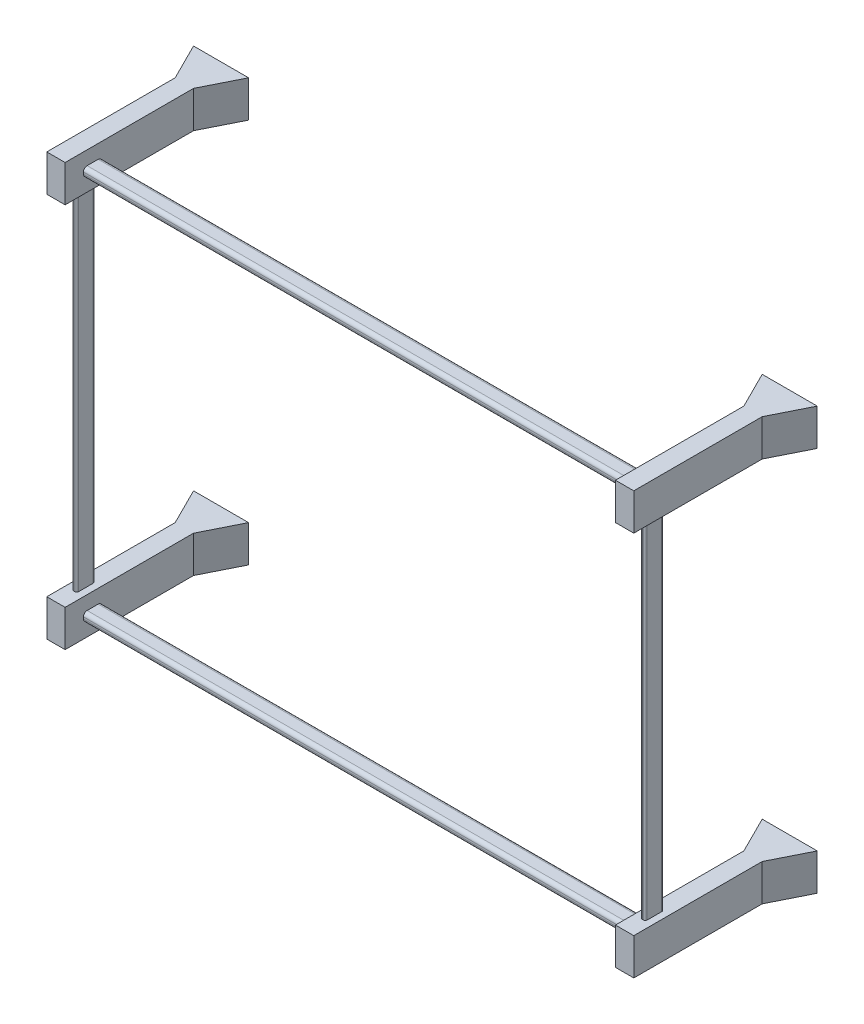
ISO-10303-21;
HEADER;
FILE_DESCRIPTION(('STEP AP214'),'2;1');
FILE_NAME('part.step','',(''),(''),'','','');
FILE_SCHEMA(('AUTOMOTIVE_DESIGN { 1 0 10303 214 1 1 1 1 }'));
ENDSEC;
DATA;
#1=APPLICATION_CONTEXT('core data for automotive mechanical design processes');
#2=APPLICATION_PROTOCOL_DEFINITION('international standard','automotive_design',2000,#1);
#3=PRODUCT_CONTEXT('',#1,'mechanical');
#4=PRODUCT('Part','Part','',(#3));
#5=PRODUCT_RELATED_PRODUCT_CATEGORY('part','',(#4));
#6=PRODUCT_DEFINITION_FORMATION('','',#4);
#7=PRODUCT_DEFINITION_CONTEXT('part definition',#1,'design');
#8=PRODUCT_DEFINITION('design','',#6,#7);
#9=PRODUCT_DEFINITION_SHAPE('','',#8);
#10=(LENGTH_UNIT() NAMED_UNIT(*) SI_UNIT(.MILLI.,.METRE.));
#11=(NAMED_UNIT(*) PLANE_ANGLE_UNIT() SI_UNIT($,.RADIAN.));
#12=(NAMED_UNIT(*) SI_UNIT($,.STERADIAN.) SOLID_ANGLE_UNIT());
#13=UNCERTAINTY_MEASURE_WITH_UNIT(LENGTH_MEASURE(1.E-05),#10,'distance_accuracy_value','');
#14=(GEOMETRIC_REPRESENTATION_CONTEXT(3) GLOBAL_UNCERTAINTY_ASSIGNED_CONTEXT((#13)) GLOBAL_UNIT_ASSIGNED_CONTEXT((#10,
#11,#12)) REPRESENTATION_CONTEXT('',''));
#15=CARTESIAN_POINT('',(0.,0.,0.));
#16=DIRECTION('',(0.,0.,1.));
#17=DIRECTION('',(1.,0.,0.));
#18=AXIS2_PLACEMENT_3D('',#15,#16,#17);
#19=CARTESIAN_POINT('',(35.71429,1499.99714,0.));
#20=DIRECTION('',(1.,0.,0.));
#21=DIRECTION('',(0.,0.,1.));
#22=AXIS2_PLACEMENT_3D('',#19,#20,#21);
#23=PLANE('',#22);
#24=DIRECTION('',(0.,-1.,0.));
#25=VECTOR('',#24,1.);
#26=CARTESIAN_POINT('',(35.71429,1503.56856857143,500.));
#27=LINE('',#26,#25);
#28=CARTESIAN_POINT('',(35.71429,1503.56856857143,500.));
#29=VERTEX_POINT('',#28);
#30=CARTESIAN_POINT('',(35.71429,1496.42571142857,500.));
#31=VERTEX_POINT('',#30);
#32=EDGE_CURVE('E538',#29,#31,#27,.T.);
#33=ORIENTED_EDGE('',*,*,#32,.T.);
#34=CARTESIAN_POINT('',(35.71429,1496.42571142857,514.285714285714));
#35=DIRECTION('',(-1.,0.,0.));
#36=DIRECTION('',(0.,0.,-1.));
#37=AXIS2_PLACEMENT_3D('',#34,#35,#36);
#38=CIRCLE('',#37,14.2857142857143);
#39=CARTESIAN_POINT('',(35.71429,1482.13999714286,514.285714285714));
#40=VERTEX_POINT('',#39);
#41=EDGE_CURVE('E509',#31,#40,#38,.T.);
#42=ORIENTED_EDGE('',*,*,#41,.T.);
#43=DIRECTION('',(0.,0.,1.));
#44=VECTOR('',#43,1.);
#45=CARTESIAN_POINT('',(35.71429,1482.13999714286,514.285714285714));
#46=LINE('',#45,#44);
#47=CARTESIAN_POINT('',(35.71429,1482.13999714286,557.142857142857));
#48=VERTEX_POINT('',#47);
#49=EDGE_CURVE('E514',#40,#48,#46,.T.);
#50=ORIENTED_EDGE('',*,*,#49,.T.);
#51=CARTESIAN_POINT('',(35.71429,1496.42571142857,557.142857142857));
#52=DIRECTION('',(-1.,0.,0.));
#53=DIRECTION('',(0.,0.,-1.));
#54=AXIS2_PLACEMENT_3D('',#51,#52,#53);
#55=CIRCLE('',#54,14.2857142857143);
#56=CARTESIAN_POINT('',(35.71429,1496.42571142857,571.428571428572));
#57=VERTEX_POINT('',#56);
#58=EDGE_CURVE('E553',#48,#57,#55,.T.);
#59=ORIENTED_EDGE('',*,*,#58,.T.);
#60=DIRECTION('',(0.,1.,0.));
#61=VECTOR('',#60,1.);
#62=CARTESIAN_POINT('',(35.71429,1503.56856857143,571.428571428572));
#63=LINE('',#62,#61);
#64=CARTESIAN_POINT('',(35.71429,1503.56856857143,571.428571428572));
#65=VERTEX_POINT('',#64);
#66=EDGE_CURVE('E550',#57,#65,#63,.T.);
#67=ORIENTED_EDGE('',*,*,#66,.T.);
#68=CARTESIAN_POINT('',(35.71429,1503.56856857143,557.142857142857));
#69=DIRECTION('',(-1.,0.,0.));
#70=DIRECTION('',(0.,0.,1.));
#71=AXIS2_PLACEMENT_3D('',#68,#69,#70);
#72=CIRCLE('',#71,14.2857142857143);
#73=CARTESIAN_POINT('',(35.71429,1517.85428285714,557.142857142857));
#74=VERTEX_POINT('',#73);
#75=EDGE_CURVE('E547',#65,#74,#72,.T.);
#76=ORIENTED_EDGE('',*,*,#75,.T.);
#77=DIRECTION('',(0.,0.,-1.));
#78=VECTOR('',#77,1.);
#79=CARTESIAN_POINT('',(35.71429,1517.85428285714,514.285714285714));
#80=LINE('',#79,#78);
#81=CARTESIAN_POINT('',(35.71429,1517.85428285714,514.285714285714));
#82=VERTEX_POINT('',#81);
#83=EDGE_CURVE('E544',#74,#82,#80,.T.);
#84=ORIENTED_EDGE('',*,*,#83,.T.);
#85=CARTESIAN_POINT('',(35.71429,1503.56856857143,514.285714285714));
#86=DIRECTION('',(-1.,0.,0.));
#87=DIRECTION('',(0.,0.,-1.));
#88=AXIS2_PLACEMENT_3D('',#85,#86,#87);
#89=CIRCLE('',#88,14.2857142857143);
#90=EDGE_CURVE('E541',#82,#29,#89,.T.);
#91=ORIENTED_EDGE('',*,*,#90,.T.);
#92=EDGE_LOOP('',(#33,#42,#50,#59,#67,#76,#84,#91));
#93=FACE_BOUND('',#92,.T.);
#94=DIRECTION('',(0.,0.,1.));
#95=VECTOR('',#94,1.);
#96=CARTESIAN_POINT('',(35.71429,1428.56856857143,0.));
#97=LINE('',#96,#95);
#98=CARTESIAN_POINT('',(35.71429,1428.56856857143,142.857142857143));
#99=VERTEX_POINT('',#98);
#100=CARTESIAN_POINT('',(35.71429,1428.56856857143,642.857142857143));
#101=VERTEX_POINT('',#100);
#102=EDGE_CURVE('E431',#99,#101,#97,.T.);
#103=ORIENTED_EDGE('',*,*,#102,.F.);
#104=DIRECTION('',(0.,1.,0.));
#105=VECTOR('',#104,1.);
#106=CARTESIAN_POINT('',(35.71429,-88.2905698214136,142.857142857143));
#107=LINE('',#106,#105);
#108=CARTESIAN_POINT('',(35.71429,1571.42571142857,142.857142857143));
#109=VERTEX_POINT('',#108);
#110=EDGE_CURVE('E413',#99,#109,#107,.T.);
#111=ORIENTED_EDGE('',*,*,#110,.T.);
#112=DIRECTION('',(0.,0.,-1.));
#113=VECTOR('',#112,1.);
#114=CARTESIAN_POINT('',(35.71429,1571.42571142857,0.));
#115=LINE('',#114,#113);
#116=CARTESIAN_POINT('',(35.71429,1571.42571142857,642.857142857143));
#117=VERTEX_POINT('',#116);
#118=EDGE_CURVE('E419',#117,#109,#115,.T.);
#119=ORIENTED_EDGE('',*,*,#118,.F.);
#120=DIRECTION('',(0.,1.,0.));
#121=VECTOR('',#120,1.);
#122=CARTESIAN_POINT('',(35.71429,1428.56856857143,642.857142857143));
#123=LINE('',#122,#121);
#124=EDGE_CURVE('E438',#101,#117,#123,.T.);
#125=ORIENTED_EDGE('',*,*,#124,.F.);
#126=EDGE_LOOP('',(#103,#111,#119,#125));
#127=FACE_BOUND('',#126,.T.);
#128=ADVANCED_FACE('F37',(#93,#127),#23,.T.);
#129=CARTESIAN_POINT('',(-35.7142814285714,1499.99714,0.));
#130=DIRECTION('',(1.,0.,0.));
#131=DIRECTION('',(0.,0.,1.));
#132=AXIS2_PLACEMENT_3D('',#129,#130,#131);
#133=PLANE('',#132);
#134=DIRECTION('',(0.,1.,0.));
#135=VECTOR('',#134,1.);
#136=CARTESIAN_POINT('',(-35.7142814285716,-88.2905698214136,142.857142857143));
#137=LINE('',#136,#135);
#138=CARTESIAN_POINT('',(-35.7142814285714,1428.56856857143,142.857142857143));
#139=VERTEX_POINT('',#138);
#140=CARTESIAN_POINT('',(-35.7142814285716,1571.42571142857,142.857142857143));
#141=VERTEX_POINT('',#140);
#142=EDGE_CURVE('E54',#139,#141,#137,.T.);
#143=ORIENTED_EDGE('',*,*,#142,.F.);
#144=DIRECTION('',(0.,0.,1.));
#145=VECTOR('',#144,1.);
#146=CARTESIAN_POINT('',(-35.7142814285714,1428.56856857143,0.));
#147=LINE('',#146,#145);
#148=CARTESIAN_POINT('',(-35.7142814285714,1428.56856857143,642.857142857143));
#149=VERTEX_POINT('',#148);
#150=EDGE_CURVE('E432',#139,#149,#147,.T.);
#151=ORIENTED_EDGE('',*,*,#150,.T.);
#152=DIRECTION('',(0.,1.,0.));
#153=VECTOR('',#152,1.);
#154=CARTESIAN_POINT('',(-35.7142814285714,1428.56856857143,642.857142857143));
#155=LINE('',#154,#153);
#156=CARTESIAN_POINT('',(-35.7142814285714,1571.42571142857,642.857142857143));
#157=VERTEX_POINT('',#156);
#158=EDGE_CURVE('E434',#149,#157,#155,.T.);
#159=ORIENTED_EDGE('',*,*,#158,.T.);
#160=DIRECTION('',(0.,0.,-1.));
#161=VECTOR('',#160,1.);
#162=CARTESIAN_POINT('',(-35.7142814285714,1571.42571142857,0.));
#163=LINE('',#162,#161);
#164=EDGE_CURVE('E405',#157,#141,#163,.T.);
#165=ORIENTED_EDGE('',*,*,#164,.T.);
#166=EDGE_LOOP('',(#143,#151,#159,#165));
#167=FACE_BOUND('',#166,.T.);
#168=ADVANCED_FACE('F889',(#167),#133,.F.);
#169=CARTESIAN_POINT('',(2250.00000142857,71.4285714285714,0.));
#170=DIRECTION('',(0.,-1.,0.));
#171=DIRECTION('',(0.,0.,-1.));
#172=AXIS2_PLACEMENT_3D('',#169,#170,#171);
#173=PLANE('',#172);
#174=DIRECTION('',(-1.,0.,0.));
#175=VECTOR('',#174,1.);
#176=CARTESIAN_POINT('',(2250.00000142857,71.4285714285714,0.));
#177=LINE('',#176,#175);
#178=CARTESIAN_POINT('',(2321.42857285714,71.4285714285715,0.));
#179=VERTEX_POINT('',#178);
#180=CARTESIAN_POINT('',(2107.14285857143,71.4285714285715,0.));
#181=VERTEX_POINT('',#180);
#182=EDGE_CURVE('E737',#179,#181,#177,.T.);
#183=ORIENTED_EDGE('',*,*,#182,.T.);
#184=DIRECTION('',(-0.447213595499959,0.,-0.894427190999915));
#185=VECTOR('',#184,1.);
#186=CARTESIAN_POINT('',(2178.57143,71.4285714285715,142.857142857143));
#187=LINE('',#186,#185);
#188=CARTESIAN_POINT('',(2178.57143,71.4285714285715,142.857142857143));
#189=VERTEX_POINT('',#188);
#190=EDGE_CURVE('E701',#189,#181,#187,.T.);
#191=ORIENTED_EDGE('',*,*,#190,.F.);
#192=DIRECTION('',(0.,0.,1.));
#193=VECTOR('',#192,1.);
#194=CARTESIAN_POINT('',(2178.57143,71.4285714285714,0.));
#195=LINE('',#194,#193);
#196=CARTESIAN_POINT('',(2178.57143,71.4285714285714,642.857142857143));
#197=VERTEX_POINT('',#196);
#198=EDGE_CURVE('E716',#189,#197,#195,.T.);
#199=ORIENTED_EDGE('',*,*,#198,.T.);
#200=DIRECTION('',(-1.,0.,0.));
#201=VECTOR('',#200,1.);
#202=CARTESIAN_POINT('',(2250.00000142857,71.4285714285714,642.857142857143));
#203=LINE('',#202,#201);
#204=CARTESIAN_POINT('',(2250.00000142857,71.4285714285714,642.857142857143));
#205=VERTEX_POINT('',#204);
#206=EDGE_CURVE('E734',#205,#197,#203,.T.);
#207=ORIENTED_EDGE('',*,*,#206,.F.);
#208=DIRECTION('',(0.,0.,1.));
#209=VECTOR('',#208,1.);
#210=CARTESIAN_POINT('',(2250.00000142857,71.4285714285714,0.));
#211=LINE('',#210,#209);
#212=CARTESIAN_POINT('',(2250.00000142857,71.4285714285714,142.857142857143));
#213=VERTEX_POINT('',#212);
#214=EDGE_CURVE('E717',#213,#205,#211,.T.);
#215=ORIENTED_EDGE('',*,*,#214,.F.);
#216=DIRECTION('',(-0.447213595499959,0.,0.894427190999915));
#217=VECTOR('',#216,1.);
#218=CARTESIAN_POINT('',(2250.00000142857,71.4285714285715,142.857142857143));
#219=LINE('',#218,#217);
#220=EDGE_CURVE('E713',#179,#213,#219,.T.);
#221=ORIENTED_EDGE('',*,*,#220,.F.);
#222=EDGE_LOOP('',(#183,#191,#199,#207,#215,#221));
#223=FACE_BOUND('',#222,.T.);
#224=CARTESIAN_POINT('',(2216.36478649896,71.42857,564.285714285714));
#225=DIRECTION('',(0.,1.,0.));
#226=DIRECTION('',(0.,0.,1.));
#227=AXIS2_PLACEMENT_3D('',#224,#225,#226);
#228=CIRCLE('',#227,7.14285714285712);
#229=CARTESIAN_POINT('',(2216.36478649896,71.42857,571.428571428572));
#230=VERTEX_POINT('',#229);
#231=CARTESIAN_POINT('',(2223.50764364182,71.4285714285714,564.285714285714));
#232=VERTEX_POINT('',#231);
#233=EDGE_CURVE('E620',#230,#232,#228,.T.);
#234=ORIENTED_EDGE('',*,*,#233,.F.);
#235=DIRECTION('',(1.,0.,0.));
#236=VECTOR('',#235,1.);
#237=CARTESIAN_POINT('',(2216.36478649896,71.42857,571.428571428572));
#238=LINE('',#237,#236);
#239=CARTESIAN_POINT('',(2212.20664492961,71.4285714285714,571.428571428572));
#240=VERTEX_POINT('',#239);
#241=EDGE_CURVE('E625',#240,#230,#238,.T.);
#242=ORIENTED_EDGE('',*,*,#241,.F.);
#243=CARTESIAN_POINT('',(2212.20664492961,71.42857,564.285714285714));
#244=DIRECTION('',(0.,1.,0.));
#245=DIRECTION('',(0.,0.,-1.));
#246=AXIS2_PLACEMENT_3D('',#243,#244,#245);
#247=CIRCLE('',#246,7.14285714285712);
#248=CARTESIAN_POINT('',(2205.06378778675,71.4285714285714,564.285714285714));
#249=VERTEX_POINT('',#248);
#250=EDGE_CURVE('E664',#249,#240,#247,.T.);
#251=ORIENTED_EDGE('',*,*,#250,.F.);
#252=DIRECTION('',(0.,0.,1.));
#253=VECTOR('',#252,1.);
#254=CARTESIAN_POINT('',(2205.06378778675,71.42857,564.285714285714));
#255=LINE('',#254,#253);
#256=CARTESIAN_POINT('',(2205.06378778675,71.4285714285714,507.142857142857));
#257=VERTEX_POINT('',#256);
#258=EDGE_CURVE('E661',#257,#249,#255,.T.);
#259=ORIENTED_EDGE('',*,*,#258,.F.);
#260=CARTESIAN_POINT('',(2212.20664492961,71.42857,507.142857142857));
#261=DIRECTION('',(0.,1.,0.));
#262=DIRECTION('',(0.,0.,1.));
#263=AXIS2_PLACEMENT_3D('',#260,#261,#262);
#264=CIRCLE('',#263,7.14285714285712);
#265=CARTESIAN_POINT('',(2212.20664492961,71.4285714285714,500.));
#266=VERTEX_POINT('',#265);
#267=EDGE_CURVE('E658',#266,#257,#264,.T.);
#268=ORIENTED_EDGE('',*,*,#267,.F.);
#269=DIRECTION('',(-1.,0.,0.));
#270=VECTOR('',#269,1.);
#271=CARTESIAN_POINT('',(2216.36478649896,71.42857,500.));
#272=LINE('',#271,#270);
#273=CARTESIAN_POINT('',(2216.36478649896,71.4285714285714,500.));
#274=VERTEX_POINT('',#273);
#275=EDGE_CURVE('E655',#274,#266,#272,.T.);
#276=ORIENTED_EDGE('',*,*,#275,.F.);
#277=CARTESIAN_POINT('',(2216.36478649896,71.42857,507.142857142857));
#278=DIRECTION('',(0.,1.,0.));
#279=DIRECTION('',(0.,0.,1.));
#280=AXIS2_PLACEMENT_3D('',#277,#278,#279);
#281=CIRCLE('',#280,7.14285714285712);
#282=CARTESIAN_POINT('',(2223.50764364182,71.4285714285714,507.142857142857));
#283=VERTEX_POINT('',#282);
#284=EDGE_CURVE('E652',#283,#274,#281,.T.);
#285=ORIENTED_EDGE('',*,*,#284,.F.);
#286=DIRECTION('',(0.,0.,-1.));
#287=VECTOR('',#286,1.);
#288=CARTESIAN_POINT('',(2223.50764364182,71.42857,564.285714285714));
#289=LINE('',#288,#287);
#290=EDGE_CURVE('E649',#232,#283,#289,.T.);
#291=ORIENTED_EDGE('',*,*,#290,.F.);
#292=EDGE_LOOP('',(#234,#242,#251,#259,#268,#276,#285,#291));
#293=FACE_BOUND('',#292,.T.);
#294=ADVANCED_FACE('F895',(#223,#293),#173,.F.);
#295=CARTESIAN_POINT('',(2178.57143,0.,0.));
#296=DIRECTION('',(-1.,0.,0.));
#297=DIRECTION('',(0.,0.,1.));
#298=AXIS2_PLACEMENT_3D('',#295,#296,#297);
#299=PLANE('',#298);
#300=DIRECTION('',(0.,1.,0.));
#301=VECTOR('',#300,1.);
#302=CARTESIAN_POINT('',(2178.57143285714,-3.57142857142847,500.));
#303=LINE('',#302,#301);
#304=CARTESIAN_POINT('',(2178.57143285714,-3.57142857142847,500.));
#305=VERTEX_POINT('',#304);
#306=CARTESIAN_POINT('',(2178.57143285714,3.57142857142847,500.));
#307=VERTEX_POINT('',#306);
#308=EDGE_CURVE('E761',#305,#307,#303,.T.);
#309=ORIENTED_EDGE('',*,*,#308,.T.);
#310=CARTESIAN_POINT('',(2178.57143285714,3.57142857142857,514.285714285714));
#311=DIRECTION('',(1.,0.,0.));
#312=DIRECTION('',(0.,0.,-1.));
#313=AXIS2_PLACEMENT_3D('',#310,#311,#312);
#314=CIRCLE('',#313,14.2857142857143);
#315=CARTESIAN_POINT('',(2178.57143285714,17.8571428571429,514.285714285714));
#316=VERTEX_POINT('',#315);
#317=EDGE_CURVE('E739',#307,#316,#314,.T.);
#318=ORIENTED_EDGE('',*,*,#317,.T.);
#319=DIRECTION('',(0.,0.,1.));
#320=VECTOR('',#319,1.);
#321=CARTESIAN_POINT('',(2178.57143285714,17.8571428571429,514.285714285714));
#322=LINE('',#321,#320);
#323=CARTESIAN_POINT('',(2178.57143285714,17.8571428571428,557.142857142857));
#324=VERTEX_POINT('',#323);
#325=EDGE_CURVE('E742',#316,#324,#322,.T.);
#326=ORIENTED_EDGE('',*,*,#325,.T.);
#327=CARTESIAN_POINT('',(2178.57143285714,3.57142857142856,557.142857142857));
#328=DIRECTION('',(1.,0.,0.));
#329=DIRECTION('',(0.,0.,-1.));
#330=AXIS2_PLACEMENT_3D('',#327,#328,#329);
#331=CIRCLE('',#330,14.2857142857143);
#332=CARTESIAN_POINT('',(2178.57143285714,3.57142857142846,571.428571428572));
#333=VERTEX_POINT('',#332);
#334=EDGE_CURVE('E746',#324,#333,#331,.T.);
#335=ORIENTED_EDGE('',*,*,#334,.T.);
#336=DIRECTION('',(0.,-1.,0.));
#337=VECTOR('',#336,1.);
#338=CARTESIAN_POINT('',(2178.57143285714,-3.57142857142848,571.428571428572));
#339=LINE('',#338,#337);
#340=CARTESIAN_POINT('',(2178.57143285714,-3.57142857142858,571.428571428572));
#341=VERTEX_POINT('',#340);
#342=EDGE_CURVE('E749',#333,#341,#339,.T.);
#343=ORIENTED_EDGE('',*,*,#342,.T.);
#344=CARTESIAN_POINT('',(2178.57143285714,-3.57142857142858,557.142857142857));
#345=DIRECTION('',(1.,0.,0.));
#346=DIRECTION('',(0.,0.,1.));
#347=AXIS2_PLACEMENT_3D('',#344,#345,#346);
#348=CIRCLE('',#347,14.2857142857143);
#349=CARTESIAN_POINT('',(2178.57143285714,-17.8571428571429,557.142857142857));
#350=VERTEX_POINT('',#349);
#351=EDGE_CURVE('E752',#341,#350,#348,.T.);
#352=ORIENTED_EDGE('',*,*,#351,.T.);
#353=DIRECTION('',(0.,0.,-1.));
#354=VECTOR('',#353,1.);
#355=CARTESIAN_POINT('',(2178.57143285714,-17.8571428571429,514.285714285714));
#356=LINE('',#355,#354);
#357=CARTESIAN_POINT('',(2178.57143285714,-17.8571428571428,514.285714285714));
#358=VERTEX_POINT('',#357);
#359=EDGE_CURVE('E755',#350,#358,#356,.T.);
#360=ORIENTED_EDGE('',*,*,#359,.T.);
#361=CARTESIAN_POINT('',(2178.57143285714,-3.57142857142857,514.285714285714));
#362=DIRECTION('',(1.,0.,0.));
#363=DIRECTION('',(0.,0.,-1.));
#364=AXIS2_PLACEMENT_3D('',#361,#362,#363);
#365=CIRCLE('',#364,14.2857142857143);
#366=EDGE_CURVE('E758',#358,#305,#365,.T.);
#367=ORIENTED_EDGE('',*,*,#366,.T.);
#368=EDGE_LOOP('',(#309,#318,#326,#335,#343,#352,#360,#367));
#369=FACE_BOUND('',#368,.T.);
#370=ORIENTED_EDGE('',*,*,#198,.F.);
#371=DIRECTION('',(0.,-1.,0.));
#372=VECTOR('',#371,1.);
#373=CARTESIAN_POINT('',(2178.57143,231.147712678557,142.857142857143));
#374=LINE('',#373,#372);
#375=CARTESIAN_POINT('',(2178.57143,-71.4285714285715,142.857142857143));
#376=VERTEX_POINT('',#375);
#377=EDGE_CURVE('E695',#189,#376,#374,.T.);
#378=ORIENTED_EDGE('',*,*,#377,.T.);
#379=DIRECTION('',(0.,0.,-1.));
#380=VECTOR('',#379,1.);
#381=CARTESIAN_POINT('',(2178.57143,-71.4285714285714,0.));
#382=LINE('',#381,#380);
#383=CARTESIAN_POINT('',(2178.57143,-71.4285714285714,642.857142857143));
#384=VERTEX_POINT('',#383);
#385=EDGE_CURVE('E720',#384,#376,#382,.T.);
#386=ORIENTED_EDGE('',*,*,#385,.F.);
#387=DIRECTION('',(0.,-1.,0.));
#388=VECTOR('',#387,1.);
#389=CARTESIAN_POINT('',(2178.57143,71.4285714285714,642.857142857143));
#390=LINE('',#389,#388);
#391=EDGE_CURVE('E726',#197,#384,#390,.T.);
#392=ORIENTED_EDGE('',*,*,#391,.F.);
#393=EDGE_LOOP('',(#370,#378,#386,#392));
#394=FACE_BOUND('',#393,.T.);
#395=ADVANCED_FACE('F858',(#369,#394),#299,.T.);
#396=CARTESIAN_POINT('',(2250.00000142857,0.,0.));
#397=DIRECTION('',(-1.,0.,0.));
#398=DIRECTION('',(0.,0.,1.));
#399=AXIS2_PLACEMENT_3D('',#396,#397,#398);
#400=PLANE('',#399);
#401=DIRECTION('',(0.,-1.,0.));
#402=VECTOR('',#401,1.);
#403=CARTESIAN_POINT('',(2250.00000142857,231.147712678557,142.857142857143));
#404=LINE('',#403,#402);
#405=CARTESIAN_POINT('',(2250.00000142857,-71.4285714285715,142.857142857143));
#406=VERTEX_POINT('',#405);
#407=EDGE_CURVE('E710',#213,#406,#404,.T.);
#408=ORIENTED_EDGE('',*,*,#407,.F.);
#409=ORIENTED_EDGE('',*,*,#214,.T.);
#410=DIRECTION('',(0.,-1.,0.));
#411=VECTOR('',#410,1.);
#412=CARTESIAN_POINT('',(2250.00000142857,71.4285714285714,642.857142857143));
#413=LINE('',#412,#411);
#414=CARTESIAN_POINT('',(2250.00000142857,-71.4285714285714,642.857142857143));
#415=VERTEX_POINT('',#414);
#416=EDGE_CURVE('E719',#205,#415,#413,.T.);
#417=ORIENTED_EDGE('',*,*,#416,.T.);
#418=DIRECTION('',(0.,0.,-1.));
#419=VECTOR('',#418,1.);
#420=CARTESIAN_POINT('',(2250.00000142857,-71.4285714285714,0.));
#421=LINE('',#420,#419);
#422=EDGE_CURVE('E722',#415,#406,#421,.T.);
#423=ORIENTED_EDGE('',*,*,#422,.T.);
#424=EDGE_LOOP('',(#408,#409,#417,#423));
#425=FACE_BOUND('',#424,.T.);
#426=ADVANCED_FACE('F1049',(#425),#400,.F.);
#427=CARTESIAN_POINT('',(107.142857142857,-71.4285714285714,642.857142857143));
#428=DIRECTION('',(0.,1.,0.));
#429=DIRECTION('',(-1.,0.,0.));
#430=AXIS2_PLACEMENT_3D('',#427,#428,#429);
#431=PLANE('',#430);
#432=DIRECTION('',(1.,0.,0.));
#433=VECTOR('',#432,1.);
#434=CARTESIAN_POINT('',(107.142857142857,-71.4285714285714,0.));
#435=LINE('',#434,#433);
#436=CARTESIAN_POINT('',(-107.142857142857,-71.4285714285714,0.));
#437=VERTEX_POINT('',#436);
#438=CARTESIAN_POINT('',(107.142857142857,-71.4285714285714,0.));
#439=VERTEX_POINT('',#438);
#440=EDGE_CURVE('E803',#437,#439,#435,.T.);
#441=ORIENTED_EDGE('',*,*,#440,.T.);
#442=DIRECTION('',(0.447213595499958,0.,-0.894427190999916));
#443=VECTOR('',#442,1.);
#444=CARTESIAN_POINT('',(107.142857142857,-71.4285714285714,0.));
#445=LINE('',#444,#443);
#446=CARTESIAN_POINT('',(35.7142857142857,-71.4285714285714,142.857142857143));
#447=VERTEX_POINT('',#446);
#448=EDGE_CURVE('E786',#447,#439,#445,.T.);
#449=ORIENTED_EDGE('',*,*,#448,.F.);
#450=DIRECTION('',(0.,0.,-1.));
#451=VECTOR('',#450,1.);
#452=CARTESIAN_POINT('',(35.7142857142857,-71.4285714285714,142.857142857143));
#453=LINE('',#452,#451);
#454=CARTESIAN_POINT('',(35.7142857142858,-71.4285714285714,642.857142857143));
#455=VERTEX_POINT('',#454);
#456=EDGE_CURVE('E783',#455,#447,#453,.T.);
#457=ORIENTED_EDGE('',*,*,#456,.F.);
#458=DIRECTION('',(1.,0.,0.));
#459=VECTOR('',#458,1.);
#460=CARTESIAN_POINT('',(107.142857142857,-71.4285714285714,642.857142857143));
#461=LINE('',#460,#459);
#462=CARTESIAN_POINT('',(-35.7142857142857,-71.4285714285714,642.857142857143));
#463=VERTEX_POINT('',#462);
#464=EDGE_CURVE('E46',#463,#455,#461,.T.);
#465=ORIENTED_EDGE('',*,*,#464,.F.);
#466=DIRECTION('',(0.,0.,1.));
#467=VECTOR('',#466,1.);
#468=CARTESIAN_POINT('',(-35.7142857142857,-71.4285714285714,642.857142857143));
#469=LINE('',#468,#467);
#470=CARTESIAN_POINT('',(-35.7142857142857,-71.4285714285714,142.857142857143));
#471=VERTEX_POINT('',#470);
#472=EDGE_CURVE('E781',#471,#463,#469,.T.);
#473=ORIENTED_EDGE('',*,*,#472,.F.);
#474=DIRECTION('',(0.447213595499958,0.,0.894427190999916));
#475=VECTOR('',#474,1.);
#476=CARTESIAN_POINT('',(-35.7142857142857,-71.4285714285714,142.857142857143));
#477=LINE('',#476,#475);
#478=EDGE_CURVE('E778',#437,#471,#477,.T.);
#479=ORIENTED_EDGE('',*,*,#478,.F.);
#480=EDGE_LOOP('',(#441,#449,#457,#465,#473,#479));
#481=FACE_BOUND('',#480,.T.);
#482=ADVANCED_FACE('F39',(#481),#431,.F.);
#483=CARTESIAN_POINT('',(107.142857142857,71.4285714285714,642.857142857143));
#484=DIRECTION('',(0.,-1.,0.));
#485=DIRECTION('',(1.,0.,0.));
#486=AXIS2_PLACEMENT_3D('',#483,#484,#485);
#487=PLANE('',#486);
#488=DIRECTION('',(0.,0.,-1.));
#489=VECTOR('',#488,1.);
#490=CARTESIAN_POINT('',(35.7142857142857,71.4285714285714,142.857142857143));
#491=LINE('',#490,#489);
#492=CARTESIAN_POINT('',(35.7142857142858,71.4285714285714,642.857142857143));
#493=VERTEX_POINT('',#492);
#494=CARTESIAN_POINT('',(35.7142857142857,71.4285714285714,142.857142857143));
#495=VERTEX_POINT('',#494);
#496=EDGE_CURVE('E772',#493,#495,#491,.T.);
#497=ORIENTED_EDGE('',*,*,#496,.T.);
#498=DIRECTION('',(0.447213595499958,0.,-0.894427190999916));
#499=VECTOR('',#498,1.);
#500=CARTESIAN_POINT('',(107.142857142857,71.4285714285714,0.));
#501=LINE('',#500,#499);
#502=CARTESIAN_POINT('',(107.142857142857,71.4285714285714,0.));
#503=VERTEX_POINT('',#502);
#504=EDGE_CURVE('E775',#495,#503,#501,.T.);
#505=ORIENTED_EDGE('',*,*,#504,.T.);
#506=DIRECTION('',(-1.,0.,0.));
#507=VECTOR('',#506,1.);
#508=CARTESIAN_POINT('',(107.142857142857,71.4285714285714,0.));
#509=LINE('',#508,#507);
#510=CARTESIAN_POINT('',(-107.142857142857,71.4285714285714,0.));
#511=VERTEX_POINT('',#510);
#512=EDGE_CURVE('E800',#503,#511,#509,.T.);
#513=ORIENTED_EDGE('',*,*,#512,.T.);
#514=DIRECTION('',(0.447213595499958,0.,0.894427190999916));
#515=VECTOR('',#514,1.);
#516=CARTESIAN_POINT('',(-35.7142857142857,71.4285714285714,142.857142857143));
#517=LINE('',#516,#515);
#518=CARTESIAN_POINT('',(-35.7142857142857,71.4285714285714,142.857142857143));
#519=VERTEX_POINT('',#518);
#520=EDGE_CURVE('E765',#511,#519,#517,.T.);
#521=ORIENTED_EDGE('',*,*,#520,.T.);
#522=DIRECTION('',(0.,0.,1.));
#523=VECTOR('',#522,1.);
#524=CARTESIAN_POINT('',(-35.7142857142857,71.4285714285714,642.857142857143));
#525=LINE('',#524,#523);
#526=CARTESIAN_POINT('',(-35.7142857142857,71.4285714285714,642.857142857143));
#527=VERTEX_POINT('',#526);
#528=EDGE_CURVE('E768',#519,#527,#525,.T.);
#529=ORIENTED_EDGE('',*,*,#528,.T.);
#530=DIRECTION('',(-1.,0.,0.));
#531=VECTOR('',#530,1.);
#532=CARTESIAN_POINT('',(107.142857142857,71.4285714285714,642.857142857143));
#533=LINE('',#532,#531);
#534=EDGE_CURVE('E12',#493,#527,#533,.T.);
#535=ORIENTED_EDGE('',*,*,#534,.F.);
#536=EDGE_LOOP('',(#497,#505,#513,#521,#529,#535));
#537=FACE_BOUND('',#536,.T.);
#538=DIRECTION('',(-1.,0.,0.));
#539=VECTOR('',#538,1.);
#540=CARTESIAN_POINT('',(-2.07906649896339,71.42857,571.428571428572));
#541=LINE('',#540,#539);
#542=CARTESIAN_POINT('',(2.07907507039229,71.42857,571.428571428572));
#543=VERTEX_POINT('',#542);
#544=CARTESIAN_POINT('',(-2.07906649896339,71.42857,571.428571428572));
#545=VERTEX_POINT('',#544);
#546=EDGE_CURVE('E476',#543,#545,#541,.T.);
#547=ORIENTED_EDGE('',*,*,#546,.T.);
#548=CARTESIAN_POINT('',(-2.07906649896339,71.42857,564.285714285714));
#549=DIRECTION('',(0.,-1.,0.));
#550=DIRECTION('',(0.,0.,1.));
#551=AXIS2_PLACEMENT_3D('',#548,#549,#550);
#552=CIRCLE('',#551,7.14285714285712);
#553=CARTESIAN_POINT('',(-9.22192364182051,71.42857,564.285714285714));
#554=VERTEX_POINT('',#553);
#555=EDGE_CURVE('E447',#545,#554,#552,.T.);
#556=ORIENTED_EDGE('',*,*,#555,.T.);
#557=DIRECTION('',(0.,0.,-1.));
#558=VECTOR('',#557,1.);
#559=CARTESIAN_POINT('',(-9.22192364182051,71.42857,564.285714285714));
#560=LINE('',#559,#558);
#561=CARTESIAN_POINT('',(-9.22192364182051,71.4285714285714,507.142857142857));
#562=VERTEX_POINT('',#561);
#563=EDGE_CURVE('E452',#554,#562,#560,.T.);
#564=ORIENTED_EDGE('',*,*,#563,.T.);
#565=CARTESIAN_POINT('',(-2.07906649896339,71.42857,507.142857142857));
#566=DIRECTION('',(0.,-1.,0.));
#567=DIRECTION('',(0.,0.,1.));
#568=AXIS2_PLACEMENT_3D('',#565,#566,#567);
#569=CIRCLE('',#568,7.14285714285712);
#570=CARTESIAN_POINT('',(-2.07906649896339,71.42857,500.));
#571=VERTEX_POINT('',#570);
#572=EDGE_CURVE('E62',#562,#571,#569,.T.);
#573=ORIENTED_EDGE('',*,*,#572,.T.);
#574=DIRECTION('',(1.,0.,0.));
#575=VECTOR('',#574,1.);
#576=CARTESIAN_POINT('',(-2.07906649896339,71.42857,500.));
#577=LINE('',#576,#575);
#578=CARTESIAN_POINT('',(2.07907507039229,71.42857,500.));
#579=VERTEX_POINT('',#578);
#580=EDGE_CURVE('E488',#571,#579,#577,.T.);
#581=ORIENTED_EDGE('',*,*,#580,.T.);
#582=CARTESIAN_POINT('',(2.07907507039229,71.42857,507.142857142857));
#583=DIRECTION('',(0.,-1.,0.));
#584=DIRECTION('',(0.,0.,1.));
#585=AXIS2_PLACEMENT_3D('',#582,#583,#584);
#586=CIRCLE('',#585,7.14285714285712);
#587=CARTESIAN_POINT('',(9.22193221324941,71.42857,507.142857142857));
#588=VERTEX_POINT('',#587);
#589=EDGE_CURVE('E485',#579,#588,#586,.T.);
#590=ORIENTED_EDGE('',*,*,#589,.T.);
#591=DIRECTION('',(0.,0.,1.));
#592=VECTOR('',#591,1.);
#593=CARTESIAN_POINT('',(9.22193221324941,71.42857,564.285714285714));
#594=LINE('',#593,#592);
#595=CARTESIAN_POINT('',(9.22193221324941,71.42857,564.285714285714));
#596=VERTEX_POINT('',#595);
#597=EDGE_CURVE('E482',#588,#596,#594,.T.);
#598=ORIENTED_EDGE('',*,*,#597,.T.);
#599=CARTESIAN_POINT('',(2.07907507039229,71.42857,564.285714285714));
#600=DIRECTION('',(0.,-1.,0.));
#601=DIRECTION('',(0.,0.,-1.));
#602=AXIS2_PLACEMENT_3D('',#599,#600,#601);
#603=CIRCLE('',#602,7.14285714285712);
#604=EDGE_CURVE('E479',#596,#543,#603,.T.);
#605=ORIENTED_EDGE('',*,*,#604,.T.);
#606=EDGE_LOOP('',(#547,#556,#564,#573,#581,#590,#598,#605));
#607=FACE_BOUND('',#606,.T.);
#608=ADVANCED_FACE('F1317',(#537,#607),#487,.F.);
#609=CARTESIAN_POINT('',(0.,0.,642.857142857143));
#610=DIRECTION('',(0.,0.,1.));
#611=DIRECTION('',(1.,0.,0.));
#612=AXIS2_PLACEMENT_3D('',#609,#610,#611);
#613=PLANE('',#612);
#614=ORIENTED_EDGE('',*,*,#464,.T.);
#615=DIRECTION('',(0.,1.,0.));
#616=VECTOR('',#615,1.);
#617=CARTESIAN_POINT('',(35.7142857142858,-71.4285714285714,642.857142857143));
#618=LINE('',#617,#616);
#619=EDGE_CURVE('E793',#455,#493,#618,.T.);
#620=ORIENTED_EDGE('',*,*,#619,.T.);
#621=ORIENTED_EDGE('',*,*,#534,.T.);
#622=DIRECTION('',(0.,1.,0.));
#623=VECTOR('',#622,1.);
#624=CARTESIAN_POINT('',(-35.7142857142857,-71.4285714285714,642.857142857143));
#625=LINE('',#624,#623);
#626=EDGE_CURVE('E796',#463,#527,#625,.T.);
#627=ORIENTED_EDGE('',*,*,#626,.F.);
#628=EDGE_LOOP('',(#614,#620,#621,#627));
#629=FACE_BOUND('',#628,.T.);
#630=ADVANCED_FACE('F1326',(#629),#613,.T.);
#631=CARTESIAN_POINT('',(0.,0.,0.));
#632=DIRECTION('',(0.,0.,1.));
#633=DIRECTION('',(1.,0.,0.));
#634=AXIS2_PLACEMENT_3D('',#631,#632,#633);
#635=PLANE('',#634);
#636=DIRECTION('',(0.,-1.,0.));
#637=VECTOR('',#636,1.);
#638=CARTESIAN_POINT('',(-107.142857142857,-71.4285714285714,0.));
#639=LINE('',#638,#637);
#640=EDGE_CURVE('E792',#511,#437,#639,.T.);
#641=ORIENTED_EDGE('',*,*,#640,.F.);
#642=ORIENTED_EDGE('',*,*,#512,.F.);
#643=DIRECTION('',(0.,1.,0.));
#644=VECTOR('',#643,1.);
#645=CARTESIAN_POINT('',(107.142857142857,-71.4285714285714,0.));
#646=LINE('',#645,#644);
#647=EDGE_CURVE('E805',#439,#503,#646,.T.);
#648=ORIENTED_EDGE('',*,*,#647,.F.);
#649=ORIENTED_EDGE('',*,*,#440,.F.);
#650=EDGE_LOOP('',(#641,#642,#648,#649));
#651=FACE_BOUND('',#650,.T.);
#652=ADVANCED_FACE('F1333',(#651),#635,.F.);
#653=CARTESIAN_POINT('',(107.142857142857,-71.4285714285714,0.));
#654=DIRECTION('',(0.894427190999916,0.,0.447213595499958));
#655=DIRECTION('',(0.447213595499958,0.,-0.894427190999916));
#656=AXIS2_PLACEMENT_3D('',#653,#654,#655);
#657=PLANE('',#656);
#658=DIRECTION('',(0.,1.,0.));
#659=VECTOR('',#658,1.);
#660=CARTESIAN_POINT('',(35.7142857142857,-71.4285714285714,142.857142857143));
#661=LINE('',#660,#659);
#662=EDGE_CURVE('E790',#447,#495,#661,.T.);
#663=ORIENTED_EDGE('',*,*,#662,.F.);
#664=ORIENTED_EDGE('',*,*,#448,.T.);
#665=ORIENTED_EDGE('',*,*,#647,.T.);
#666=ORIENTED_EDGE('',*,*,#504,.F.);
#667=EDGE_LOOP('',(#663,#664,#665,#666));
#668=FACE_BOUND('',#667,.T.);
#669=ADVANCED_FACE('F1337',(#668),#657,.T.);
#670=CARTESIAN_POINT('',(35.7142857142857,-71.4285714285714,142.857142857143));
#671=DIRECTION('',(1.,0.,0.));
#672=DIRECTION('',(0.,0.,-1.));
#673=AXIS2_PLACEMENT_3D('',#670,#671,#672);
#674=PLANE('',#673);
#675=CARTESIAN_POINT('',(35.7142857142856,3.57142857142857,514.285714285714));
#676=DIRECTION('',(1.,0.,0.));
#677=DIRECTION('',(0.,0.,-1.));
#678=AXIS2_PLACEMENT_3D('',#675,#676,#677);
#679=CIRCLE('',#678,14.2857142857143);
#680=CARTESIAN_POINT('',(35.7142857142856,3.57142857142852,500.));
#681=VERTEX_POINT('',#680);
#682=CARTESIAN_POINT('',(35.7142857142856,17.8571428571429,514.285714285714));
#683=VERTEX_POINT('',#682);
#684=EDGE_CURVE('E41',#681,#683,#679,.T.);
#685=ORIENTED_EDGE('',*,*,#684,.F.);
#686=DIRECTION('',(0.,1.,0.));
#687=VECTOR('',#686,1.);
#688=CARTESIAN_POINT('',(35.7142857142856,-3.57142857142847,500.));
#689=LINE('',#688,#687);
#690=CARTESIAN_POINT('',(35.7142857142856,-3.57142857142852,500.));
#691=VERTEX_POINT('',#690);
#692=EDGE_CURVE('E743',#691,#681,#689,.T.);
#693=ORIENTED_EDGE('',*,*,#692,.F.);
#694=CARTESIAN_POINT('',(35.7142857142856,-3.57142857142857,514.285714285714));
#695=DIRECTION('',(1.,0.,0.));
#696=DIRECTION('',(0.,0.,-1.));
#697=AXIS2_PLACEMENT_3D('',#694,#695,#696);
#698=CIRCLE('',#697,14.2857142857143);
#699=CARTESIAN_POINT('',(35.7142857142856,-17.8571428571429,514.285714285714));
#700=VERTEX_POINT('',#699);
#701=EDGE_CURVE('E845',#700,#691,#698,.T.);
#702=ORIENTED_EDGE('',*,*,#701,.F.);
#703=DIRECTION('',(0.,0.,-1.));
#704=VECTOR('',#703,1.);
#705=CARTESIAN_POINT('',(35.7142857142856,-17.8571428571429,514.285714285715));
#706=LINE('',#705,#704);
#707=CARTESIAN_POINT('',(35.7142857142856,-17.8571428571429,557.142857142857));
#708=VERTEX_POINT('',#707);
#709=EDGE_CURVE('E842',#708,#700,#706,.T.);
#710=ORIENTED_EDGE('',*,*,#709,.F.);
#711=CARTESIAN_POINT('',(35.7142857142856,-3.57142857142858,557.142857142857));
#712=DIRECTION('',(1.,0.,0.));
#713=DIRECTION('',(0.,0.,-1.));
#714=AXIS2_PLACEMENT_3D('',#711,#712,#713);
#715=CIRCLE('',#714,14.2857142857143);
#716=CARTESIAN_POINT('',(35.7142857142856,-3.57142857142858,571.428571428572));
#717=VERTEX_POINT('',#716);
#718=EDGE_CURVE('E839',#717,#708,#715,.T.);
#719=ORIENTED_EDGE('',*,*,#718,.F.);
#720=DIRECTION('',(0.,-1.,0.));
#721=VECTOR('',#720,1.);
#722=CARTESIAN_POINT('',(35.7142857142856,-3.57142857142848,571.428571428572));
#723=LINE('',#722,#721);
#724=CARTESIAN_POINT('',(35.7142857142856,3.57142857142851,571.428571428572));
#725=VERTEX_POINT('',#724);
#726=EDGE_CURVE('E836',#725,#717,#723,.T.);
#727=ORIENTED_EDGE('',*,*,#726,.F.);
#728=CARTESIAN_POINT('',(35.7142857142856,3.57142857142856,557.142857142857));
#729=DIRECTION('',(1.,0.,0.));
#730=DIRECTION('',(0.,0.,-1.));
#731=AXIS2_PLACEMENT_3D('',#728,#729,#730);
#732=CIRCLE('',#731,14.2857142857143);
#733=CARTESIAN_POINT('',(35.7142857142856,17.8571428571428,557.142857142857));
#734=VERTEX_POINT('',#733);
#735=EDGE_CURVE('E833',#734,#725,#732,.T.);
#736=ORIENTED_EDGE('',*,*,#735,.F.);
#737=DIRECTION('',(0.,0.,1.));
#738=VECTOR('',#737,1.);
#739=CARTESIAN_POINT('',(35.7142857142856,17.8571428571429,514.285714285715));
#740=LINE('',#739,#738);
#741=EDGE_CURVE('E830',#683,#734,#740,.T.);
#742=ORIENTED_EDGE('',*,*,#741,.F.);
#743=EDGE_LOOP('',(#685,#693,#702,#710,#719,#727,#736,#742));
#744=FACE_BOUND('',#743,.T.);
#745=ORIENTED_EDGE('',*,*,#619,.F.);
#746=ORIENTED_EDGE('',*,*,#456,.T.);
#747=ORIENTED_EDGE('',*,*,#662,.T.);
#748=ORIENTED_EDGE('',*,*,#496,.F.);
#749=EDGE_LOOP('',(#745,#746,#747,#748));
#750=FACE_BOUND('',#749,.T.);
#751=ADVANCED_FACE('F864',(#744,#750),#674,.T.);
#752=CARTESIAN_POINT('',(-35.7142857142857,-71.4285714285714,142.857142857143));
#753=DIRECTION('',(-0.894427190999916,0.,0.447213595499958));
#754=DIRECTION('',(0.447213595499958,0.,0.894427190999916));
#755=AXIS2_PLACEMENT_3D('',#752,#753,#754);
#756=PLANE('',#755);
#757=ORIENTED_EDGE('',*,*,#640,.T.);
#758=ORIENTED_EDGE('',*,*,#478,.T.);
#759=DIRECTION('',(0.,1.,0.));
#760=VECTOR('',#759,1.);
#761=CARTESIAN_POINT('',(-35.7142857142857,-71.4285714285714,142.857142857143));
#762=LINE('',#761,#760);
#763=EDGE_CURVE('E789',#471,#519,#762,.T.);
#764=ORIENTED_EDGE('',*,*,#763,.T.);
#765=ORIENTED_EDGE('',*,*,#520,.F.);
#766=EDGE_LOOP('',(#757,#758,#764,#765));
#767=FACE_BOUND('',#766,.T.);
#768=ADVANCED_FACE('F1356',(#767),#756,.T.);
#769=CARTESIAN_POINT('',(-35.7142857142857,-71.4285714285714,642.857142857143));
#770=DIRECTION('',(-1.,0.,0.));
#771=DIRECTION('',(0.,0.,1.));
#772=AXIS2_PLACEMENT_3D('',#769,#770,#771);
#773=PLANE('',#772);
#774=ORIENTED_EDGE('',*,*,#763,.F.);
#775=ORIENTED_EDGE('',*,*,#472,.T.);
#776=ORIENTED_EDGE('',*,*,#626,.T.);
#777=ORIENTED_EDGE('',*,*,#528,.F.);
#778=EDGE_LOOP('',(#774,#775,#776,#777));
#779=FACE_BOUND('',#778,.T.);
#780=ADVANCED_FACE('F886',(#779),#773,.T.);
#781=CARTESIAN_POINT('',(2178.57143285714,3.57142857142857,514.285714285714));
#782=DIRECTION('',(-1.,0.,0.));
#783=DIRECTION('',(0.,0.,1.));
#784=AXIS2_PLACEMENT_3D('',#781,#782,#783);
#785=CYLINDRICAL_SURFACE('',#784,14.2857142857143);
#786=ORIENTED_EDGE('',*,*,#684,.T.);
#787=DIRECTION('',(-1.,0.,0.));
#788=VECTOR('',#787,1.);
#789=CARTESIAN_POINT('',(2178.57143285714,17.8571428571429,514.285714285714));
#790=LINE('',#789,#788);
#791=EDGE_CURVE('E769',#316,#683,#790,.T.);
#792=ORIENTED_EDGE('',*,*,#791,.F.);
#793=ORIENTED_EDGE('',*,*,#317,.F.);
#794=DIRECTION('',(-1.,0.,0.));
#795=VECTOR('',#794,1.);
#796=CARTESIAN_POINT('',(2178.57143285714,3.57142857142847,500.));
#797=LINE('',#796,#795);
#798=EDGE_CURVE('E764',#307,#681,#797,.T.);
#799=ORIENTED_EDGE('',*,*,#798,.T.);
#800=EDGE_LOOP('',(#786,#792,#793,#799));
#801=FACE_BOUND('',#800,.T.);
#802=ADVANCED_FACE('F855',(#801),#785,.T.);
#803=CARTESIAN_POINT('',(2178.57143285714,17.8571428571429,514.285714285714));
#804=DIRECTION('',(0.,-1.,0.));
#805=DIRECTION('',(0.,0.,-1.));
#806=AXIS2_PLACEMENT_3D('',#803,#804,#805);
#807=PLANE('',#806);
#808=ORIENTED_EDGE('',*,*,#741,.T.);
#809=DIRECTION('',(-1.,0.,0.));
#810=VECTOR('',#809,1.);
#811=CARTESIAN_POINT('',(2178.57143285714,17.8571428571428,557.142857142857));
#812=LINE('',#811,#810);
#813=EDGE_CURVE('E808',#324,#734,#812,.T.);
#814=ORIENTED_EDGE('',*,*,#813,.F.);
#815=ORIENTED_EDGE('',*,*,#325,.F.);
#816=ORIENTED_EDGE('',*,*,#791,.T.);
#817=EDGE_LOOP('',(#808,#814,#815,#816));
#818=FACE_BOUND('',#817,.T.);
#819=ADVANCED_FACE('F878',(#818),#807,.F.);
#820=CARTESIAN_POINT('',(2178.57143285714,3.57142857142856,557.142857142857));
#821=DIRECTION('',(-1.,0.,0.));
#822=DIRECTION('',(0.,0.,1.));
#823=AXIS2_PLACEMENT_3D('',#820,#821,#822);
#824=CYLINDRICAL_SURFACE('',#823,14.2857142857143);
#825=ORIENTED_EDGE('',*,*,#735,.T.);
#826=DIRECTION('',(-1.,0.,0.));
#827=VECTOR('',#826,1.);
#828=CARTESIAN_POINT('',(2178.57143285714,3.57142857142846,571.428571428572));
#829=LINE('',#828,#827);
#830=EDGE_CURVE('E811',#333,#725,#829,.T.);
#831=ORIENTED_EDGE('',*,*,#830,.F.);
#832=ORIENTED_EDGE('',*,*,#334,.F.);
#833=ORIENTED_EDGE('',*,*,#813,.T.);
#834=EDGE_LOOP('',(#825,#831,#832,#833));
#835=FACE_BOUND('',#834,.T.);
#836=ADVANCED_FACE('F876',(#835),#824,.T.);
#837=CARTESIAN_POINT('',(2178.57143285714,-3.57142857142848,571.428571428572));
#838=DIRECTION('',(0.,0.,-1.));
#839=DIRECTION('',(-1.,0.,0.));
#840=AXIS2_PLACEMENT_3D('',#837,#838,#839);
#841=PLANE('',#840);
#842=ORIENTED_EDGE('',*,*,#726,.T.);
#843=DIRECTION('',(-1.,0.,0.));
#844=VECTOR('',#843,1.);
#845=CARTESIAN_POINT('',(2178.57143285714,-3.57142857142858,571.428571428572));
#846=LINE('',#845,#844);
#847=EDGE_CURVE('E825',#341,#717,#846,.T.);
#848=ORIENTED_EDGE('',*,*,#847,.F.);
#849=ORIENTED_EDGE('',*,*,#342,.F.);
#850=ORIENTED_EDGE('',*,*,#830,.T.);
#851=EDGE_LOOP('',(#842,#848,#849,#850));
#852=FACE_BOUND('',#851,.T.);
#853=ADVANCED_FACE('F872',(#852),#841,.F.);
#854=CARTESIAN_POINT('',(2178.57143285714,-3.57142857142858,557.142857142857));
#855=DIRECTION('',(-1.,0.,0.));
#856=DIRECTION('',(0.,0.,1.));
#857=AXIS2_PLACEMENT_3D('',#854,#855,#856);
#858=CYLINDRICAL_SURFACE('',#857,14.2857142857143);
#859=ORIENTED_EDGE('',*,*,#718,.T.);
#860=DIRECTION('',(-1.,0.,0.));
#861=VECTOR('',#860,1.);
#862=CARTESIAN_POINT('',(2178.57143285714,-17.8571428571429,557.142857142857));
#863=LINE('',#862,#861);
#864=EDGE_CURVE('E822',#350,#708,#863,.T.);
#865=ORIENTED_EDGE('',*,*,#864,.F.);
#866=ORIENTED_EDGE('',*,*,#351,.F.);
#867=ORIENTED_EDGE('',*,*,#847,.T.);
#868=EDGE_LOOP('',(#859,#865,#866,#867));
#869=FACE_BOUND('',#868,.T.);
#870=ADVANCED_FACE('F870',(#869),#858,.T.);
#871=CARTESIAN_POINT('',(2178.57143285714,-17.8571428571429,514.285714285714));
#872=DIRECTION('',(0.,1.,0.));
#873=DIRECTION('',(0.,0.,1.));
#874=AXIS2_PLACEMENT_3D('',#871,#872,#873);
#875=PLANE('',#874);
#876=ORIENTED_EDGE('',*,*,#709,.T.);
#877=DIRECTION('',(-1.,0.,0.));
#878=VECTOR('',#877,1.);
#879=CARTESIAN_POINT('',(2178.57143285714,-17.8571428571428,514.285714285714));
#880=LINE('',#879,#878);
#881=EDGE_CURVE('E819',#358,#700,#880,.T.);
#882=ORIENTED_EDGE('',*,*,#881,.F.);
#883=ORIENTED_EDGE('',*,*,#359,.F.);
#884=ORIENTED_EDGE('',*,*,#864,.T.);
#885=EDGE_LOOP('',(#876,#882,#883,#884));
#886=FACE_BOUND('',#885,.T.);
#887=ADVANCED_FACE('F867',(#886),#875,.F.);
#888=CARTESIAN_POINT('',(2178.57143285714,-3.57142857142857,514.285714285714));
#889=DIRECTION('',(-1.,0.,0.));
#890=DIRECTION('',(0.,0.,1.));
#891=AXIS2_PLACEMENT_3D('',#888,#889,#890);
#892=CYLINDRICAL_SURFACE('',#891,14.2857142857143);
#893=ORIENTED_EDGE('',*,*,#701,.T.);
#894=DIRECTION('',(-1.,0.,0.));
#895=VECTOR('',#894,1.);
#896=CARTESIAN_POINT('',(2178.57143285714,-3.57142857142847,500.));
#897=LINE('',#896,#895);
#898=EDGE_CURVE('E816',#305,#691,#897,.T.);
#899=ORIENTED_EDGE('',*,*,#898,.F.);
#900=ORIENTED_EDGE('',*,*,#366,.F.);
#901=ORIENTED_EDGE('',*,*,#881,.T.);
#902=EDGE_LOOP('',(#893,#899,#900,#901));
#903=FACE_BOUND('',#902,.T.);
#904=ADVANCED_FACE('F863',(#903),#892,.T.);
#905=CARTESIAN_POINT('',(2178.57143285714,-3.57142857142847,500.));
#906=DIRECTION('',(0.,0.,1.));
#907=DIRECTION('',(1.,0.,0.));
#908=AXIS2_PLACEMENT_3D('',#905,#906,#907);
#909=PLANE('',#908);
#910=ORIENTED_EDGE('',*,*,#692,.T.);
#911=ORIENTED_EDGE('',*,*,#798,.F.);
#912=ORIENTED_EDGE('',*,*,#308,.F.);
#913=ORIENTED_EDGE('',*,*,#898,.T.);
#914=EDGE_LOOP('',(#910,#911,#912,#913));
#915=FACE_BOUND('',#914,.T.);
#916=ADVANCED_FACE('F850',(#915),#909,.F.);
#917=CARTESIAN_POINT('',(2250.00000142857,71.4285714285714,0.));
#918=DIRECTION('',(0.,0.,1.));
#919=DIRECTION('',(1.,0.,0.));
#920=AXIS2_PLACEMENT_3D('',#917,#918,#919);
#921=PLANE('',#920);
#922=DIRECTION('',(-1.,0.,0.));
#923=VECTOR('',#922,1.);
#924=CARTESIAN_POINT('',(2250.00000142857,-71.4285714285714,0.));
#925=LINE('',#924,#923);
#926=CARTESIAN_POINT('',(2321.42857285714,-71.4285714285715,0.));
#927=VERTEX_POINT('',#926);
#928=CARTESIAN_POINT('',(2107.14285857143,-71.4285714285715,0.));
#929=VERTEX_POINT('',#928);
#930=EDGE_CURVE('E724',#927,#929,#925,.T.);
#931=ORIENTED_EDGE('',*,*,#930,.T.);
#932=DIRECTION('',(0.,-1.,0.));
#933=VECTOR('',#932,1.);
#934=CARTESIAN_POINT('',(2107.14285857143,231.147712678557,0.));
#935=LINE('',#934,#933);
#936=EDGE_CURVE('E698',#181,#929,#935,.T.);
#937=ORIENTED_EDGE('',*,*,#936,.F.);
#938=ORIENTED_EDGE('',*,*,#182,.F.);
#939=DIRECTION('',(0.,-1.,0.));
#940=VECTOR('',#939,1.);
#941=CARTESIAN_POINT('',(2321.42857285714,231.147712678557,0.));
#942=LINE('',#941,#940);
#943=EDGE_CURVE('E707',#179,#927,#942,.T.);
#944=ORIENTED_EDGE('',*,*,#943,.T.);
#945=EDGE_LOOP('',(#931,#937,#938,#944));
#946=FACE_BOUND('',#945,.T.);
#947=ADVANCED_FACE('F1061',(#946),#921,.F.);
#948=CARTESIAN_POINT('',(2250.00000142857,71.4285714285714,642.857142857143));
#949=DIRECTION('',(0.,0.,-1.));
#950=DIRECTION('',(-1.,0.,0.));
#951=AXIS2_PLACEMENT_3D('',#948,#949,#950);
#952=PLANE('',#951);
#953=ORIENTED_EDGE('',*,*,#391,.T.);
#954=DIRECTION('',(-1.,0.,0.));
#955=VECTOR('',#954,1.);
#956=CARTESIAN_POINT('',(2250.00000142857,-71.4285714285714,642.857142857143));
#957=LINE('',#956,#955);
#958=EDGE_CURVE('E731',#415,#384,#957,.T.);
#959=ORIENTED_EDGE('',*,*,#958,.F.);
#960=ORIENTED_EDGE('',*,*,#416,.F.);
#961=ORIENTED_EDGE('',*,*,#206,.T.);
#962=EDGE_LOOP('',(#953,#959,#960,#961));
#963=FACE_BOUND('',#962,.T.);
#964=ADVANCED_FACE('F1057',(#963),#952,.F.);
#965=CARTESIAN_POINT('',(2250.00000142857,-71.4285714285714,0.));
#966=DIRECTION('',(0.,1.,0.));
#967=DIRECTION('',(0.,0.,1.));
#968=AXIS2_PLACEMENT_3D('',#965,#966,#967);
#969=PLANE('',#968);
#970=ORIENTED_EDGE('',*,*,#385,.T.);
#971=DIRECTION('',(-0.447213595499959,0.,-0.894427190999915));
#972=VECTOR('',#971,1.);
#973=CARTESIAN_POINT('',(2178.57143,-71.4285714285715,142.857142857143));
#974=LINE('',#973,#972);
#975=EDGE_CURVE('E692',#376,#929,#974,.T.);
#976=ORIENTED_EDGE('',*,*,#975,.T.);
#977=ORIENTED_EDGE('',*,*,#930,.F.);
#978=DIRECTION('',(-0.447213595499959,0.,0.894427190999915));
#979=VECTOR('',#978,1.);
#980=CARTESIAN_POINT('',(2250.00000142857,-71.4285714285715,142.857142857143));
#981=LINE('',#980,#979);
#982=EDGE_CURVE('E704',#927,#406,#981,.T.);
#983=ORIENTED_EDGE('',*,*,#982,.T.);
#984=ORIENTED_EDGE('',*,*,#422,.F.);
#985=ORIENTED_EDGE('',*,*,#958,.T.);
#986=EDGE_LOOP('',(#970,#976,#977,#983,#984,#985));
#987=FACE_BOUND('',#986,.T.);
#988=ADVANCED_FACE('F1047',(#987),#969,.F.);
#989=CARTESIAN_POINT('',(2250.00000142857,231.147712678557,142.857142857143));
#990=DIRECTION('',(-0.894427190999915,0.,-0.447213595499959));
#991=DIRECTION('',(-0.447213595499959,0.,0.894427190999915));
#992=AXIS2_PLACEMENT_3D('',#989,#990,#991);
#993=PLANE('',#992);
#994=ORIENTED_EDGE('',*,*,#943,.F.);
#995=ORIENTED_EDGE('',*,*,#220,.T.);
#996=ORIENTED_EDGE('',*,*,#407,.T.);
#997=ORIENTED_EDGE('',*,*,#982,.F.);
#998=EDGE_LOOP('',(#994,#995,#996,#997));
#999=FACE_BOUND('',#998,.T.);
#1000=ADVANCED_FACE('F1043',(#999),#993,.F.);
#1001=CARTESIAN_POINT('',(2178.57143,231.147712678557,142.857142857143));
#1002=DIRECTION('',(0.894427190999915,0.,-0.447213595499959));
#1003=DIRECTION('',(-0.447213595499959,0.,-0.894427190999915));
#1004=AXIS2_PLACEMENT_3D('',#1001,#1002,#1003);
#1005=PLANE('',#1004);
#1006=ORIENTED_EDGE('',*,*,#377,.F.);
#1007=ORIENTED_EDGE('',*,*,#190,.T.);
#1008=ORIENTED_EDGE('',*,*,#936,.T.);
#1009=ORIENTED_EDGE('',*,*,#975,.F.);
#1010=EDGE_LOOP('',(#1006,#1007,#1008,#1009));
#1011=FACE_BOUND('',#1010,.T.);
#1012=ADVANCED_FACE('F1039',(#1011),#1005,.F.);
#1013=CARTESIAN_POINT('',(2216.36478649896,1428.56857,564.285714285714));
#1014=DIRECTION('',(0.,-1.,0.));
#1015=DIRECTION('',(0.,0.,-1.));
#1016=AXIS2_PLACEMENT_3D('',#1013,#1014,#1015);
#1017=CYLINDRICAL_SURFACE('',#1016,7.14285714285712);
#1018=ORIENTED_EDGE('',*,*,#233,.T.);
#1019=DIRECTION('',(0.,-1.,0.));
#1020=VECTOR('',#1019,1.);
#1021=CARTESIAN_POINT('',(2223.50764364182,1428.56857,564.285714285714));
#1022=LINE('',#1021,#1020);
#1023=CARTESIAN_POINT('',(2223.50764364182,1428.56857,564.285714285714));
#1024=VERTEX_POINT('',#1023);
#1025=EDGE_CURVE('E689',#1024,#232,#1022,.T.);
#1026=ORIENTED_EDGE('',*,*,#1025,.F.);
#1027=CARTESIAN_POINT('',(2216.36478649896,1428.56857,564.285714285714));
#1028=DIRECTION('',(0.,1.,0.));
#1029=DIRECTION('',(0.,0.,1.));
#1030=AXIS2_PLACEMENT_3D('',#1027,#1028,#1029);
#1031=CIRCLE('',#1030,7.14285714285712);
#1032=CARTESIAN_POINT('',(2216.36478649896,1428.56857,571.428571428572));
#1033=VERTEX_POINT('',#1032);
#1034=EDGE_CURVE('E621',#1033,#1024,#1031,.T.);
#1035=ORIENTED_EDGE('',*,*,#1034,.F.);
#1036=DIRECTION('',(0.,-1.,0.));
#1037=VECTOR('',#1036,1.);
#1038=CARTESIAN_POINT('',(2216.36478649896,1428.56857,571.428571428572));
#1039=LINE('',#1038,#1037);
#1040=EDGE_CURVE('E646',#1033,#230,#1039,.T.);
#1041=ORIENTED_EDGE('',*,*,#1040,.T.);
#1042=EDGE_LOOP('',(#1018,#1026,#1035,#1041));
#1043=FACE_BOUND('',#1042,.T.);
#1044=ADVANCED_FACE('F1035',(#1043),#1017,.T.);
#1045=CARTESIAN_POINT('',(2223.50764364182,1428.56857,564.285714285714));
#1046=DIRECTION('',(-1.,0.,0.));
#1047=DIRECTION('',(0.,0.,1.));
#1048=AXIS2_PLACEMENT_3D('',#1045,#1046,#1047);
#1049=PLANE('',#1048);
#1050=ORIENTED_EDGE('',*,*,#290,.T.);
#1051=DIRECTION('',(0.,-1.,0.));
#1052=VECTOR('',#1051,1.);
#1053=CARTESIAN_POINT('',(2223.50764364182,1428.56857,507.142857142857));
#1054=LINE('',#1053,#1052);
#1055=CARTESIAN_POINT('',(2223.50764364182,1428.56857,507.142857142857));
#1056=VERTEX_POINT('',#1055);
#1057=EDGE_CURVE('E686',#1056,#283,#1054,.T.);
#1058=ORIENTED_EDGE('',*,*,#1057,.F.);
#1059=DIRECTION('',(0.,0.,-1.));
#1060=VECTOR('',#1059,1.);
#1061=CARTESIAN_POINT('',(2223.50764364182,1428.56857,564.285714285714));
#1062=LINE('',#1061,#1060);
#1063=EDGE_CURVE('E624',#1024,#1056,#1062,.T.);
#1064=ORIENTED_EDGE('',*,*,#1063,.F.);
#1065=ORIENTED_EDGE('',*,*,#1025,.T.);
#1066=EDGE_LOOP('',(#1050,#1058,#1064,#1065));
#1067=FACE_BOUND('',#1066,.T.);
#1068=ADVANCED_FACE('F1031',(#1067),#1049,.F.);
#1069=CARTESIAN_POINT('',(2216.36478649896,1428.56857,507.142857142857));
#1070=DIRECTION('',(0.,-1.,0.));
#1071=DIRECTION('',(0.,0.,-1.));
#1072=AXIS2_PLACEMENT_3D('',#1069,#1070,#1071);
#1073=CYLINDRICAL_SURFACE('',#1072,7.14285714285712);
#1074=ORIENTED_EDGE('',*,*,#284,.T.);
#1075=DIRECTION('',(0.,-1.,0.));
#1076=VECTOR('',#1075,1.);
#1077=CARTESIAN_POINT('',(2216.36478649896,1428.56857,500.));
#1078=LINE('',#1077,#1076);
#1079=CARTESIAN_POINT('',(2216.36478649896,1428.56857,500.));
#1080=VERTEX_POINT('',#1079);
#1081=EDGE_CURVE('E683',#1080,#274,#1078,.T.);
#1082=ORIENTED_EDGE('',*,*,#1081,.F.);
#1083=CARTESIAN_POINT('',(2216.36478649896,1428.56857,507.142857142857));
#1084=DIRECTION('',(0.,1.,0.));
#1085=DIRECTION('',(0.,0.,1.));
#1086=AXIS2_PLACEMENT_3D('',#1083,#1084,#1085);
#1087=CIRCLE('',#1086,7.14285714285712);
#1088=EDGE_CURVE('E628',#1056,#1080,#1087,.T.);
#1089=ORIENTED_EDGE('',*,*,#1088,.F.);
#1090=ORIENTED_EDGE('',*,*,#1057,.T.);
#1091=EDGE_LOOP('',(#1074,#1082,#1089,#1090));
#1092=FACE_BOUND('',#1091,.T.);
#1093=ADVANCED_FACE('F1027',(#1092),#1073,.T.);
#1094=CARTESIAN_POINT('',(2216.36478649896,1428.56857,500.));
#1095=DIRECTION('',(0.,0.,1.));
#1096=DIRECTION('',(1.,0.,0.));
#1097=AXIS2_PLACEMENT_3D('',#1094,#1095,#1096);
#1098=PLANE('',#1097);
#1099=ORIENTED_EDGE('',*,*,#275,.T.);
#1100=DIRECTION('',(0.,-1.,0.));
#1101=VECTOR('',#1100,1.);
#1102=CARTESIAN_POINT('',(2212.20664492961,1428.56857,500.));
#1103=LINE('',#1102,#1101);
#1104=CARTESIAN_POINT('',(2212.20664492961,1428.56857,500.));
#1105=VERTEX_POINT('',#1104);
#1106=EDGE_CURVE('E680',#1105,#266,#1103,.T.);
#1107=ORIENTED_EDGE('',*,*,#1106,.F.);
#1108=DIRECTION('',(-1.,0.,0.));
#1109=VECTOR('',#1108,1.);
#1110=CARTESIAN_POINT('',(2216.36478649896,1428.56857,500.));
#1111=LINE('',#1110,#1109);
#1112=EDGE_CURVE('E631',#1080,#1105,#1111,.T.);
#1113=ORIENTED_EDGE('',*,*,#1112,.F.);
#1114=ORIENTED_EDGE('',*,*,#1081,.T.);
#1115=EDGE_LOOP('',(#1099,#1107,#1113,#1114));
#1116=FACE_BOUND('',#1115,.T.);
#1117=ADVANCED_FACE('F1023',(#1116),#1098,.F.);
#1118=CARTESIAN_POINT('',(2212.20664492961,1428.56857,507.142857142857));
#1119=DIRECTION('',(0.,-1.,0.));
#1120=DIRECTION('',(0.,0.,-1.));
#1121=AXIS2_PLACEMENT_3D('',#1118,#1119,#1120);
#1122=CYLINDRICAL_SURFACE('',#1121,7.14285714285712);
#1123=ORIENTED_EDGE('',*,*,#267,.T.);
#1124=DIRECTION('',(0.,-1.,0.));
#1125=VECTOR('',#1124,1.);
#1126=CARTESIAN_POINT('',(2205.06378778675,1428.56857,507.142857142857));
#1127=LINE('',#1126,#1125);
#1128=CARTESIAN_POINT('',(2205.06378778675,1428.56857,507.142857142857));
#1129=VERTEX_POINT('',#1128);
#1130=EDGE_CURVE('E677',#1129,#257,#1127,.T.);
#1131=ORIENTED_EDGE('',*,*,#1130,.F.);
#1132=CARTESIAN_POINT('',(2212.20664492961,1428.56857,507.142857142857));
#1133=DIRECTION('',(0.,1.,0.));
#1134=DIRECTION('',(0.,0.,1.));
#1135=AXIS2_PLACEMENT_3D('',#1132,#1133,#1134);
#1136=CIRCLE('',#1135,7.14285714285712);
#1137=EDGE_CURVE('E634',#1105,#1129,#1136,.T.);
#1138=ORIENTED_EDGE('',*,*,#1137,.F.);
#1139=ORIENTED_EDGE('',*,*,#1106,.T.);
#1140=EDGE_LOOP('',(#1123,#1131,#1138,#1139));
#1141=FACE_BOUND('',#1140,.T.);
#1142=ADVANCED_FACE('F1019',(#1141),#1122,.T.);
#1143=CARTESIAN_POINT('',(2205.06378778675,1428.56857,564.285714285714));
#1144=DIRECTION('',(1.,0.,0.));
#1145=DIRECTION('',(0.,0.,-1.));
#1146=AXIS2_PLACEMENT_3D('',#1143,#1144,#1145);
#1147=PLANE('',#1146);
#1148=ORIENTED_EDGE('',*,*,#258,.T.);
#1149=DIRECTION('',(0.,-1.,0.));
#1150=VECTOR('',#1149,1.);
#1151=CARTESIAN_POINT('',(2205.06378778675,1428.56857,564.285714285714));
#1152=LINE('',#1151,#1150);
#1153=CARTESIAN_POINT('',(2205.06378778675,1428.56857,564.285714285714));
#1154=VERTEX_POINT('',#1153);
#1155=EDGE_CURVE('E674',#1154,#249,#1152,.T.);
#1156=ORIENTED_EDGE('',*,*,#1155,.F.);
#1157=DIRECTION('',(0.,0.,1.));
#1158=VECTOR('',#1157,1.);
#1159=CARTESIAN_POINT('',(2205.06378778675,1428.56857,564.285714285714));
#1160=LINE('',#1159,#1158);
#1161=EDGE_CURVE('E637',#1129,#1154,#1160,.T.);
#1162=ORIENTED_EDGE('',*,*,#1161,.F.);
#1163=ORIENTED_EDGE('',*,*,#1130,.T.);
#1164=EDGE_LOOP('',(#1148,#1156,#1162,#1163));
#1165=FACE_BOUND('',#1164,.T.);
#1166=ADVANCED_FACE('F1015',(#1165),#1147,.F.);
#1167=CARTESIAN_POINT('',(2212.20664492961,1428.56857,564.285714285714));
#1168=DIRECTION('',(0.,-1.,0.));
#1169=DIRECTION('',(0.,0.,-1.));
#1170=AXIS2_PLACEMENT_3D('',#1167,#1168,#1169);
#1171=CYLINDRICAL_SURFACE('',#1170,7.14285714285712);
#1172=ORIENTED_EDGE('',*,*,#250,.T.);
#1173=DIRECTION('',(0.,-1.,0.));
#1174=VECTOR('',#1173,1.);
#1175=CARTESIAN_POINT('',(2212.20664492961,1428.56857,571.428571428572));
#1176=LINE('',#1175,#1174);
#1177=CARTESIAN_POINT('',(2212.20664492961,1428.56857,571.428571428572));
#1178=VERTEX_POINT('',#1177);
#1179=EDGE_CURVE('E671',#1178,#240,#1176,.T.);
#1180=ORIENTED_EDGE('',*,*,#1179,.F.);
#1181=CARTESIAN_POINT('',(2212.20664492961,1428.56857,564.285714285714));
#1182=DIRECTION('',(0.,1.,0.));
#1183=DIRECTION('',(0.,0.,-1.));
#1184=AXIS2_PLACEMENT_3D('',#1181,#1182,#1183);
#1185=CIRCLE('',#1184,7.14285714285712);
#1186=EDGE_CURVE('E640',#1154,#1178,#1185,.T.);
#1187=ORIENTED_EDGE('',*,*,#1186,.F.);
#1188=ORIENTED_EDGE('',*,*,#1155,.T.);
#1189=EDGE_LOOP('',(#1172,#1180,#1187,#1188));
#1190=FACE_BOUND('',#1189,.T.);
#1191=ADVANCED_FACE('F1011',(#1190),#1171,.T.);
#1192=CARTESIAN_POINT('',(2216.36478649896,1428.56857,571.428571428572));
#1193=DIRECTION('',(0.,0.,-1.));
#1194=DIRECTION('',(-1.,0.,0.));
#1195=AXIS2_PLACEMENT_3D('',#1192,#1193,#1194);
#1196=PLANE('',#1195);
#1197=ORIENTED_EDGE('',*,*,#241,.T.);
#1198=ORIENTED_EDGE('',*,*,#1040,.F.);
#1199=DIRECTION('',(1.,0.,0.));
#1200=VECTOR('',#1199,1.);
#1201=CARTESIAN_POINT('',(2216.36478649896,1428.56857,571.428571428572));
#1202=LINE('',#1201,#1200);
#1203=EDGE_CURVE('E643',#1178,#1033,#1202,.T.);
#1204=ORIENTED_EDGE('',*,*,#1203,.F.);
#1205=ORIENTED_EDGE('',*,*,#1179,.T.);
#1206=EDGE_LOOP('',(#1197,#1198,#1204,#1205));
#1207=FACE_BOUND('',#1206,.T.);
#1208=ADVANCED_FACE('F1007',(#1207),#1196,.F.);
#1209=CARTESIAN_POINT('',(2250.00000142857,1428.56856857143,0.));
#1210=DIRECTION('',(0.,0.,-1.));
#1211=DIRECTION('',(-1.,0.,0.));
#1212=AXIS2_PLACEMENT_3D('',#1209,#1210,#1211);
#1213=PLANE('',#1212);
#1214=DIRECTION('',(-1.,0.,0.));
#1215=VECTOR('',#1214,1.);
#1216=CARTESIAN_POINT('',(2250.00000142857,1428.56856857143,0.));
#1217=LINE('',#1216,#1215);
#1218=CARTESIAN_POINT('',(2321.42857285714,1428.56856857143,0.));
#1219=VERTEX_POINT('',#1218);
#1220=CARTESIAN_POINT('',(2107.14285857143,1428.56856857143,0.));
#1221=VERTEX_POINT('',#1220);
#1222=EDGE_CURVE('E606',#1219,#1221,#1217,.T.);
#1223=ORIENTED_EDGE('',*,*,#1222,.T.);
#1224=DIRECTION('',(0.,1.,0.));
#1225=VECTOR('',#1224,1.);
#1226=CARTESIAN_POINT('',(2107.14285857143,-88.2905698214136,0.));
#1227=LINE('',#1226,#1225);
#1228=CARTESIAN_POINT('',(2107.14285857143,1571.42571142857,0.));
#1229=VERTEX_POINT('',#1228);
#1230=EDGE_CURVE('E577',#1221,#1229,#1227,.T.);
#1231=ORIENTED_EDGE('',*,*,#1230,.T.);
#1232=DIRECTION('',(-1.,0.,0.));
#1233=VECTOR('',#1232,1.);
#1234=CARTESIAN_POINT('',(2250.00000142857,1571.42571142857,0.));
#1235=LINE('',#1234,#1233);
#1236=CARTESIAN_POINT('',(2321.42857285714,1571.42571142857,0.));
#1237=VERTEX_POINT('',#1236);
#1238=EDGE_CURVE('E618',#1237,#1229,#1235,.T.);
#1239=ORIENTED_EDGE('',*,*,#1238,.F.);
#1240=DIRECTION('',(0.,1.,0.));
#1241=VECTOR('',#1240,1.);
#1242=CARTESIAN_POINT('',(2321.42857285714,-88.2905698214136,0.));
#1243=LINE('',#1242,#1241);
#1244=EDGE_CURVE('E592',#1219,#1237,#1243,.T.);
#1245=ORIENTED_EDGE('',*,*,#1244,.F.);
#1246=EDGE_LOOP('',(#1223,#1231,#1239,#1245));
#1247=FACE_BOUND('',#1246,.T.);
#1248=ADVANCED_FACE('F1003',(#1247),#1213,.T.);
#1249=CARTESIAN_POINT('',(2250.00000142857,1571.42571142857,0.));
#1250=DIRECTION('',(0.,1.,0.));
#1251=DIRECTION('',(0.,0.,1.));
#1252=AXIS2_PLACEMENT_3D('',#1249,#1250,#1251);
#1253=PLANE('',#1252);
#1254=DIRECTION('',(0.,0.,-1.));
#1255=VECTOR('',#1254,1.);
#1256=CARTESIAN_POINT('',(2178.57143,1571.42571142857,0.));
#1257=LINE('',#1256,#1255);
#1258=CARTESIAN_POINT('',(2178.57143,1571.42571142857,642.857142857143));
#1259=VERTEX_POINT('',#1258);
#1260=CARTESIAN_POINT('',(2178.57143,1571.42571142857,142.857142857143));
#1261=VERTEX_POINT('',#1260);
#1262=EDGE_CURVE('E591',#1259,#1261,#1257,.T.);
#1263=ORIENTED_EDGE('',*,*,#1262,.F.);
#1264=DIRECTION('',(-1.,0.,0.));
#1265=VECTOR('',#1264,1.);
#1266=CARTESIAN_POINT('',(2250.00000142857,1571.42571142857,642.857142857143));
#1267=LINE('',#1266,#1265);
#1268=CARTESIAN_POINT('',(2250.00000142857,1571.42571142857,642.857142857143));
#1269=VERTEX_POINT('',#1268);
#1270=EDGE_CURVE('E616',#1269,#1259,#1267,.T.);
#1271=ORIENTED_EDGE('',*,*,#1270,.F.);
#1272=DIRECTION('',(0.,0.,-1.));
#1273=VECTOR('',#1272,1.);
#1274=CARTESIAN_POINT('',(2250.00000142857,1571.42571142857,0.));
#1275=LINE('',#1274,#1273);
#1276=CARTESIAN_POINT('',(2250.00000142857,1571.42571142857,142.857142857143));
#1277=VERTEX_POINT('',#1276);
#1278=EDGE_CURVE('E597',#1269,#1277,#1275,.T.);
#1279=ORIENTED_EDGE('',*,*,#1278,.T.);
#1280=DIRECTION('',(-0.447213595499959,0.,0.894427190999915));
#1281=VECTOR('',#1280,1.);
#1282=CARTESIAN_POINT('',(2250.00000142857,1571.42571142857,142.857142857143));
#1283=LINE('',#1282,#1281);
#1284=EDGE_CURVE('E581',#1237,#1277,#1283,.T.);
#1285=ORIENTED_EDGE('',*,*,#1284,.F.);
#1286=ORIENTED_EDGE('',*,*,#1238,.T.);
#1287=DIRECTION('',(-0.447213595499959,0.,-0.894427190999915));
#1288=VECTOR('',#1287,1.);
#1289=CARTESIAN_POINT('',(2178.57143,1571.42571142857,142.857142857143));
#1290=LINE('',#1289,#1288);
#1291=EDGE_CURVE('E574',#1261,#1229,#1290,.T.);
#1292=ORIENTED_EDGE('',*,*,#1291,.F.);
#1293=EDGE_LOOP('',(#1263,#1271,#1279,#1285,#1286,#1292));
#1294=FACE_BOUND('',#1293,.T.);
#1295=ADVANCED_FACE('F999',(#1294),#1253,.T.);
#1296=CARTESIAN_POINT('',(2250.00000142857,1428.56856857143,642.857142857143));
#1297=DIRECTION('',(0.,0.,1.));
#1298=DIRECTION('',(1.,0.,0.));
#1299=AXIS2_PLACEMENT_3D('',#1296,#1297,#1298);
#1300=PLANE('',#1299);
#1301=DIRECTION('',(0.,1.,0.));
#1302=VECTOR('',#1301,1.);
#1303=CARTESIAN_POINT('',(2178.57143,1428.56856857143,642.857142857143));
#1304=LINE('',#1303,#1302);
#1305=CARTESIAN_POINT('',(2178.57143,1428.56856857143,642.857142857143));
#1306=VERTEX_POINT('',#1305);
#1307=EDGE_CURVE('E608',#1306,#1259,#1304,.T.);
#1308=ORIENTED_EDGE('',*,*,#1307,.F.);
#1309=DIRECTION('',(-1.,0.,0.));
#1310=VECTOR('',#1309,1.);
#1311=CARTESIAN_POINT('',(2250.00000142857,1428.56856857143,642.857142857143));
#1312=LINE('',#1311,#1310);
#1313=CARTESIAN_POINT('',(2250.00000142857,1428.56856857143,642.857142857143));
#1314=VERTEX_POINT('',#1313);
#1315=EDGE_CURVE('E613',#1314,#1306,#1312,.T.);
#1316=ORIENTED_EDGE('',*,*,#1315,.F.);
#1317=DIRECTION('',(0.,1.,0.));
#1318=VECTOR('',#1317,1.);
#1319=CARTESIAN_POINT('',(2250.00000142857,1428.56856857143,642.857142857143));
#1320=LINE('',#1319,#1318);
#1321=EDGE_CURVE('E600',#1314,#1269,#1320,.T.);
#1322=ORIENTED_EDGE('',*,*,#1321,.T.);
#1323=ORIENTED_EDGE('',*,*,#1270,.T.);
#1324=EDGE_LOOP('',(#1308,#1316,#1322,#1323));
#1325=FACE_BOUND('',#1324,.T.);
#1326=ADVANCED_FACE('F995',(#1325),#1300,.T.);
#1327=CARTESIAN_POINT('',(2250.00000142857,1428.56856857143,0.));
#1328=DIRECTION('',(0.,-1.,0.));
#1329=DIRECTION('',(0.,0.,-1.));
#1330=AXIS2_PLACEMENT_3D('',#1327,#1328,#1329);
#1331=PLANE('',#1330);
#1332=ORIENTED_EDGE('',*,*,#1203,.T.);
#1333=ORIENTED_EDGE('',*,*,#1034,.T.);
#1334=ORIENTED_EDGE('',*,*,#1063,.T.);
#1335=ORIENTED_EDGE('',*,*,#1088,.T.);
#1336=ORIENTED_EDGE('',*,*,#1112,.T.);
#1337=ORIENTED_EDGE('',*,*,#1137,.T.);
#1338=ORIENTED_EDGE('',*,*,#1161,.T.);
#1339=ORIENTED_EDGE('',*,*,#1186,.T.);
#1340=EDGE_LOOP('',(#1332,#1333,#1334,#1335,#1336,#1337,#1338,#1339));
#1341=FACE_BOUND('',#1340,.T.);
#1342=DIRECTION('',(0.,0.,1.));
#1343=VECTOR('',#1342,1.);
#1344=CARTESIAN_POINT('',(2178.57143,1428.56856857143,0.));
#1345=LINE('',#1344,#1343);
#1346=CARTESIAN_POINT('',(2178.57143,1428.56856857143,142.857142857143));
#1347=VERTEX_POINT('',#1346);
#1348=EDGE_CURVE('E601',#1347,#1306,#1345,.T.);
#1349=ORIENTED_EDGE('',*,*,#1348,.F.);
#1350=DIRECTION('',(-0.447213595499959,0.,-0.894427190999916));
#1351=VECTOR('',#1350,1.);
#1352=CARTESIAN_POINT('',(2178.57143,1428.56856857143,142.857142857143));
#1353=LINE('',#1352,#1351);
#1354=EDGE_CURVE('E578',#1347,#1221,#1353,.T.);
#1355=ORIENTED_EDGE('',*,*,#1354,.T.);
#1356=ORIENTED_EDGE('',*,*,#1222,.F.);
#1357=DIRECTION('',(-0.447213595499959,0.,0.894427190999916));
#1358=VECTOR('',#1357,1.);
#1359=CARTESIAN_POINT('',(2250.00000142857,1428.56856857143,142.857142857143));
#1360=LINE('',#1359,#1358);
#1361=CARTESIAN_POINT('',(2250.00000142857,1428.56856857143,142.857142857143));
#1362=VERTEX_POINT('',#1361);
#1363=EDGE_CURVE('E589',#1219,#1362,#1360,.T.);
#1364=ORIENTED_EDGE('',*,*,#1363,.T.);
#1365=DIRECTION('',(0.,0.,1.));
#1366=VECTOR('',#1365,1.);
#1367=CARTESIAN_POINT('',(2250.00000142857,1428.56856857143,0.));
#1368=LINE('',#1367,#1366);
#1369=EDGE_CURVE('E604',#1362,#1314,#1368,.T.);
#1370=ORIENTED_EDGE('',*,*,#1369,.T.);
#1371=ORIENTED_EDGE('',*,*,#1315,.T.);
#1372=EDGE_LOOP('',(#1349,#1355,#1356,#1364,#1370,#1371));
#1373=FACE_BOUND('',#1372,.T.);
#1374=ADVANCED_FACE('F988',(#1341,#1373),#1331,.T.);
#1375=CARTESIAN_POINT('',(2250.00000142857,1499.99714,0.));
#1376=DIRECTION('',(-1.,0.,0.));
#1377=DIRECTION('',(0.,0.,1.));
#1378=AXIS2_PLACEMENT_3D('',#1375,#1376,#1377);
#1379=PLANE('',#1378);
#1380=ORIENTED_EDGE('',*,*,#1369,.F.);
#1381=DIRECTION('',(0.,1.,0.));
#1382=VECTOR('',#1381,1.);
#1383=CARTESIAN_POINT('',(2250.00000142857,-88.2905698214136,142.857142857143));
#1384=LINE('',#1383,#1382);
#1385=EDGE_CURVE('E588',#1362,#1277,#1384,.T.);
#1386=ORIENTED_EDGE('',*,*,#1385,.T.);
#1387=ORIENTED_EDGE('',*,*,#1278,.F.);
#1388=ORIENTED_EDGE('',*,*,#1321,.F.);
#1389=EDGE_LOOP('',(#1380,#1386,#1387,#1388));
#1390=FACE_BOUND('',#1389,.T.);
#1391=ADVANCED_FACE('F985',(#1390),#1379,.F.);
#1392=CARTESIAN_POINT('',(2178.57143,1499.99714,0.));
#1393=DIRECTION('',(-1.,0.,0.));
#1394=DIRECTION('',(0.,0.,1.));
#1395=AXIS2_PLACEMENT_3D('',#1392,#1393,#1394);
#1396=PLANE('',#1395);
#1397=CARTESIAN_POINT('',(2178.57143285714,1496.42571142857,514.285714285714));
#1398=DIRECTION('',(-1.,0.,0.));
#1399=DIRECTION('',(0.,0.,-1.));
#1400=AXIS2_PLACEMENT_3D('',#1397,#1398,#1399);
#1401=CIRCLE('',#1400,14.2857142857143);
#1402=CARTESIAN_POINT('',(2178.57143,1496.42571142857,500.));
#1403=VERTEX_POINT('',#1402);
#1404=CARTESIAN_POINT('',(2178.57143,1482.13999714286,514.285714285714));
#1405=VERTEX_POINT('',#1404);
#1406=EDGE_CURVE('E510',#1403,#1405,#1401,.T.);
#1407=ORIENTED_EDGE('',*,*,#1406,.F.);
#1408=DIRECTION('',(0.,-1.,0.));
#1409=VECTOR('',#1408,1.);
#1410=CARTESIAN_POINT('',(2178.57143285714,1503.56856857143,500.));
#1411=LINE('',#1410,#1409);
#1412=CARTESIAN_POINT('',(2178.57143,1503.56856857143,500.));
#1413=VERTEX_POINT('',#1412);
#1414=EDGE_CURVE('E513',#1413,#1403,#1411,.T.);
#1415=ORIENTED_EDGE('',*,*,#1414,.F.);
#1416=CARTESIAN_POINT('',(2178.57143285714,1503.56856857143,514.285714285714));
#1417=DIRECTION('',(-1.,0.,0.));
#1418=DIRECTION('',(0.,0.,-1.));
#1419=AXIS2_PLACEMENT_3D('',#1416,#1417,#1418);
#1420=CIRCLE('',#1419,14.2857142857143);
#1421=CARTESIAN_POINT('',(2178.57143,1517.85428285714,514.285714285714));
#1422=VERTEX_POINT('',#1421);
#1423=EDGE_CURVE('E517',#1422,#1413,#1420,.T.);
#1424=ORIENTED_EDGE('',*,*,#1423,.F.);
#1425=DIRECTION('',(0.,0.,-1.));
#1426=VECTOR('',#1425,1.);
#1427=CARTESIAN_POINT('',(2178.57143285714,1517.85428285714,514.285714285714));
#1428=LINE('',#1427,#1426);
#1429=CARTESIAN_POINT('',(2178.57143,1517.85428285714,557.142857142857));
#1430=VERTEX_POINT('',#1429);
#1431=EDGE_CURVE('E520',#1430,#1422,#1428,.T.);
#1432=ORIENTED_EDGE('',*,*,#1431,.F.);
#1433=CARTESIAN_POINT('',(2178.57143285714,1503.56856857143,557.142857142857));
#1434=DIRECTION('',(-1.,0.,0.));
#1435=DIRECTION('',(0.,0.,1.));
#1436=AXIS2_PLACEMENT_3D('',#1433,#1434,#1435);
#1437=CIRCLE('',#1436,14.2857142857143);
#1438=CARTESIAN_POINT('',(2178.57143,1503.56856857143,571.428571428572));
#1439=VERTEX_POINT('',#1438);
#1440=EDGE_CURVE('E523',#1439,#1430,#1437,.T.);
#1441=ORIENTED_EDGE('',*,*,#1440,.F.);
#1442=DIRECTION('',(0.,1.,0.));
#1443=VECTOR('',#1442,1.);
#1444=CARTESIAN_POINT('',(2178.57143285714,1503.56856857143,571.428571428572));
#1445=LINE('',#1444,#1443);
#1446=CARTESIAN_POINT('',(2178.57143,1496.42571142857,571.428571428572));
#1447=VERTEX_POINT('',#1446);
#1448=EDGE_CURVE('E526',#1447,#1439,#1445,.T.);
#1449=ORIENTED_EDGE('',*,*,#1448,.F.);
#1450=CARTESIAN_POINT('',(2178.57143285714,1496.42571142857,557.142857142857));
#1451=DIRECTION('',(-1.,0.,0.));
#1452=DIRECTION('',(0.,0.,-1.));
#1453=AXIS2_PLACEMENT_3D('',#1450,#1451,#1452);
#1454=CIRCLE('',#1453,14.2857142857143);
#1455=CARTESIAN_POINT('',(2178.57143285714,1482.13999714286,557.142857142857));
#1456=VERTEX_POINT('',#1455);
#1457=EDGE_CURVE('E529',#1456,#1447,#1454,.T.);
#1458=ORIENTED_EDGE('',*,*,#1457,.F.);
#1459=DIRECTION('',(0.,0.,1.));
#1460=VECTOR('',#1459,1.);
#1461=CARTESIAN_POINT('',(2178.57143285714,1482.13999714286,514.285714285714));
#1462=LINE('',#1461,#1460);
#1463=EDGE_CURVE('E532',#1405,#1456,#1462,.T.);
#1464=ORIENTED_EDGE('',*,*,#1463,.F.);
#1465=EDGE_LOOP('',(#1407,#1415,#1424,#1432,#1441,#1449,#1458,#1464));
#1466=FACE_BOUND('',#1465,.T.);
#1467=DIRECTION('',(0.,1.,0.));
#1468=VECTOR('',#1467,1.);
#1469=CARTESIAN_POINT('',(2178.57143,-88.2905698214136,142.857142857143));
#1470=LINE('',#1469,#1468);
#1471=EDGE_CURVE('E582',#1347,#1261,#1470,.T.);
#1472=ORIENTED_EDGE('',*,*,#1471,.F.);
#1473=ORIENTED_EDGE('',*,*,#1348,.T.);
#1474=ORIENTED_EDGE('',*,*,#1307,.T.);
#1475=ORIENTED_EDGE('',*,*,#1262,.T.);
#1476=EDGE_LOOP('',(#1472,#1473,#1474,#1475));
#1477=FACE_BOUND('',#1476,.T.);
#1478=ADVANCED_FACE('F983',(#1466,#1477),#1396,.T.);
#1479=CARTESIAN_POINT('',(2250.00000142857,-88.2905698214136,142.857142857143));
#1480=DIRECTION('',(0.894427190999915,0.,0.447213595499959));
#1481=DIRECTION('',(0.447213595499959,0.,-0.894427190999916));
#1482=AXIS2_PLACEMENT_3D('',#1479,#1480,#1481);
#1483=PLANE('',#1482);
#1484=ORIENTED_EDGE('',*,*,#1363,.F.);
#1485=ORIENTED_EDGE('',*,*,#1244,.T.);
#1486=ORIENTED_EDGE('',*,*,#1284,.T.);
#1487=ORIENTED_EDGE('',*,*,#1385,.F.);
#1488=EDGE_LOOP('',(#1484,#1485,#1486,#1487));
#1489=FACE_BOUND('',#1488,.T.);
#1490=ADVANCED_FACE('F979',(#1489),#1483,.T.);
#1491=CARTESIAN_POINT('',(2178.57143,-88.2905698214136,142.857142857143));
#1492=DIRECTION('',(-0.894427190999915,0.,0.447213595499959));
#1493=DIRECTION('',(0.447213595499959,0.,0.894427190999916));
#1494=AXIS2_PLACEMENT_3D('',#1491,#1492,#1493);
#1495=PLANE('',#1494);
#1496=ORIENTED_EDGE('',*,*,#1354,.F.);
#1497=ORIENTED_EDGE('',*,*,#1471,.T.);
#1498=ORIENTED_EDGE('',*,*,#1291,.T.);
#1499=ORIENTED_EDGE('',*,*,#1230,.F.);
#1500=EDGE_LOOP('',(#1496,#1497,#1498,#1499));
#1501=FACE_BOUND('',#1500,.T.);
#1502=ADVANCED_FACE('F975',(#1501),#1495,.T.);
#1503=CARTESIAN_POINT('',(2178.57143285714,1496.42571142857,514.285714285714));
#1504=DIRECTION('',(-1.,0.,0.));
#1505=DIRECTION('',(0.,0.,1.));
#1506=AXIS2_PLACEMENT_3D('',#1503,#1504,#1505);
#1507=CYLINDRICAL_SURFACE('',#1506,14.2857142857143);
#1508=ORIENTED_EDGE('',*,*,#41,.F.);
#1509=DIRECTION('',(-1.,0.,0.));
#1510=VECTOR('',#1509,1.);
#1511=CARTESIAN_POINT('',(2178.57143285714,1496.42571142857,500.));
#1512=LINE('',#1511,#1510);
#1513=EDGE_CURVE('E571',#1403,#31,#1512,.T.);
#1514=ORIENTED_EDGE('',*,*,#1513,.F.);
#1515=ORIENTED_EDGE('',*,*,#1406,.T.);
#1516=DIRECTION('',(-1.,0.,0.));
#1517=VECTOR('',#1516,1.);
#1518=CARTESIAN_POINT('',(2178.57143285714,1482.13999714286,514.285714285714));
#1519=LINE('',#1518,#1517);
#1520=EDGE_CURVE('E535',#1405,#40,#1519,.T.);
#1521=ORIENTED_EDGE('',*,*,#1520,.T.);
#1522=EDGE_LOOP('',(#1508,#1514,#1515,#1521));
#1523=FACE_BOUND('',#1522,.T.);
#1524=ADVANCED_FACE('F971',(#1523),#1507,.T.);
#1525=CARTESIAN_POINT('',(2178.57143285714,1503.56856857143,500.));
#1526=DIRECTION('',(0.,0.,-1.));
#1527=DIRECTION('',(-1.,0.,0.));
#1528=AXIS2_PLACEMENT_3D('',#1525,#1526,#1527);
#1529=PLANE('',#1528);
#1530=ORIENTED_EDGE('',*,*,#32,.F.);
#1531=DIRECTION('',(-1.,0.,0.));
#1532=VECTOR('',#1531,1.);
#1533=CARTESIAN_POINT('',(2178.57143285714,1503.56856857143,500.));
#1534=LINE('',#1533,#1532);
#1535=EDGE_CURVE('E569',#1413,#29,#1534,.T.);
#1536=ORIENTED_EDGE('',*,*,#1535,.F.);
#1537=ORIENTED_EDGE('',*,*,#1414,.T.);
#1538=ORIENTED_EDGE('',*,*,#1513,.T.);
#1539=EDGE_LOOP('',(#1530,#1536,#1537,#1538));
#1540=FACE_BOUND('',#1539,.T.);
#1541=ADVANCED_FACE('F967',(#1540),#1529,.T.);
#1542=CARTESIAN_POINT('',(2178.57143285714,1503.56856857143,514.285714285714));
#1543=DIRECTION('',(-1.,0.,0.));
#1544=DIRECTION('',(0.,0.,1.));
#1545=AXIS2_PLACEMENT_3D('',#1542,#1543,#1544);
#1546=CYLINDRICAL_SURFACE('',#1545,14.2857142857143);
#1547=ORIENTED_EDGE('',*,*,#90,.F.);
#1548=DIRECTION('',(-1.,0.,0.));
#1549=VECTOR('',#1548,1.);
#1550=CARTESIAN_POINT('',(2178.57143285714,1517.85428285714,514.285714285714));
#1551=LINE('',#1550,#1549);
#1552=EDGE_CURVE('E567',#1422,#82,#1551,.T.);
#1553=ORIENTED_EDGE('',*,*,#1552,.F.);
#1554=ORIENTED_EDGE('',*,*,#1423,.T.);
#1555=ORIENTED_EDGE('',*,*,#1535,.T.);
#1556=EDGE_LOOP('',(#1547,#1553,#1554,#1555));
#1557=FACE_BOUND('',#1556,.T.);
#1558=ADVANCED_FACE('F963',(#1557),#1546,.T.);
#1559=CARTESIAN_POINT('',(2178.57143285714,1517.85428285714,514.285714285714));
#1560=DIRECTION('',(0.,1.,0.));
#1561=DIRECTION('',(0.,0.,1.));
#1562=AXIS2_PLACEMENT_3D('',#1559,#1560,#1561);
#1563=PLANE('',#1562);
#1564=ORIENTED_EDGE('',*,*,#83,.F.);
#1565=DIRECTION('',(-1.,0.,0.));
#1566=VECTOR('',#1565,1.);
#1567=CARTESIAN_POINT('',(2178.57143285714,1517.85428285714,557.142857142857));
#1568=LINE('',#1567,#1566);
#1569=EDGE_CURVE('E565',#1430,#74,#1568,.T.);
#1570=ORIENTED_EDGE('',*,*,#1569,.F.);
#1571=ORIENTED_EDGE('',*,*,#1431,.T.);
#1572=ORIENTED_EDGE('',*,*,#1552,.T.);
#1573=EDGE_LOOP('',(#1564,#1570,#1571,#1572));
#1574=FACE_BOUND('',#1573,.T.);
#1575=ADVANCED_FACE('F959',(#1574),#1563,.T.);
#1576=CARTESIAN_POINT('',(2178.57143285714,1503.56856857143,557.142857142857));
#1577=DIRECTION('',(-1.,0.,0.));
#1578=DIRECTION('',(0.,0.,1.));
#1579=AXIS2_PLACEMENT_3D('',#1576,#1577,#1578);
#1580=CYLINDRICAL_SURFACE('',#1579,14.2857142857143);
#1581=ORIENTED_EDGE('',*,*,#75,.F.);
#1582=DIRECTION('',(-1.,0.,0.));
#1583=VECTOR('',#1582,1.);
#1584=CARTESIAN_POINT('',(2178.57143285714,1503.56856857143,571.428571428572));
#1585=LINE('',#1584,#1583);
#1586=EDGE_CURVE('E563',#1439,#65,#1585,.T.);
#1587=ORIENTED_EDGE('',*,*,#1586,.F.);
#1588=ORIENTED_EDGE('',*,*,#1440,.T.);
#1589=ORIENTED_EDGE('',*,*,#1569,.T.);
#1590=EDGE_LOOP('',(#1581,#1587,#1588,#1589));
#1591=FACE_BOUND('',#1590,.T.);
#1592=ADVANCED_FACE('F955',(#1591),#1580,.T.);
#1593=CARTESIAN_POINT('',(2178.57143285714,1503.56856857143,571.428571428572));
#1594=DIRECTION('',(0.,0.,1.));
#1595=DIRECTION('',(1.,0.,0.));
#1596=AXIS2_PLACEMENT_3D('',#1593,#1594,#1595);
#1597=PLANE('',#1596);
#1598=ORIENTED_EDGE('',*,*,#66,.F.);
#1599=DIRECTION('',(-1.,0.,0.));
#1600=VECTOR('',#1599,1.);
#1601=CARTESIAN_POINT('',(2178.57143285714,1496.42571142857,571.428571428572));
#1602=LINE('',#1601,#1600);
#1603=EDGE_CURVE('E561',#1447,#57,#1602,.T.);
#1604=ORIENTED_EDGE('',*,*,#1603,.F.);
#1605=ORIENTED_EDGE('',*,*,#1448,.T.);
#1606=ORIENTED_EDGE('',*,*,#1586,.T.);
#1607=EDGE_LOOP('',(#1598,#1604,#1605,#1606));
#1608=FACE_BOUND('',#1607,.T.);
#1609=ADVANCED_FACE('F951',(#1608),#1597,.T.);
#1610=CARTESIAN_POINT('',(2178.57143285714,1496.42571142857,557.142857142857));
#1611=DIRECTION('',(-1.,0.,0.));
#1612=DIRECTION('',(0.,0.,1.));
#1613=AXIS2_PLACEMENT_3D('',#1610,#1611,#1612);
#1614=CYLINDRICAL_SURFACE('',#1613,14.2857142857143);
#1615=ORIENTED_EDGE('',*,*,#58,.F.);
#1616=DIRECTION('',(-1.,0.,0.));
#1617=VECTOR('',#1616,1.);
#1618=CARTESIAN_POINT('',(2178.57143285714,1482.13999714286,557.142857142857));
#1619=LINE('',#1618,#1617);
#1620=EDGE_CURVE('E559',#1456,#48,#1619,.T.);
#1621=ORIENTED_EDGE('',*,*,#1620,.F.);
#1622=ORIENTED_EDGE('',*,*,#1457,.T.);
#1623=ORIENTED_EDGE('',*,*,#1603,.T.);
#1624=EDGE_LOOP('',(#1615,#1621,#1622,#1623));
#1625=FACE_BOUND('',#1624,.T.);
#1626=ADVANCED_FACE('F947',(#1625),#1614,.T.);
#1627=CARTESIAN_POINT('',(2178.57143285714,1482.13999714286,514.285714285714));
#1628=DIRECTION('',(0.,-1.,0.));
#1629=DIRECTION('',(0.,0.,-1.));
#1630=AXIS2_PLACEMENT_3D('',#1627,#1628,#1629);
#1631=PLANE('',#1630);
#1632=ORIENTED_EDGE('',*,*,#49,.F.);
#1633=ORIENTED_EDGE('',*,*,#1520,.F.);
#1634=ORIENTED_EDGE('',*,*,#1463,.T.);
#1635=ORIENTED_EDGE('',*,*,#1620,.T.);
#1636=EDGE_LOOP('',(#1632,#1633,#1634,#1635));
#1637=FACE_BOUND('',#1636,.T.);
#1638=ADVANCED_FACE('F943',(#1637),#1631,.T.);
#1639=CARTESIAN_POINT('',(-2.07906649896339,1428.56857,564.285714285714));
#1640=DIRECTION('',(0.,-1.,0.));
#1641=DIRECTION('',(0.,0.,-1.));
#1642=AXIS2_PLACEMENT_3D('',#1639,#1640,#1641);
#1643=CYLINDRICAL_SURFACE('',#1642,7.14285714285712);
#1644=ORIENTED_EDGE('',*,*,#555,.F.);
#1645=DIRECTION('',(0.,-1.,0.));
#1646=VECTOR('',#1645,1.);
#1647=CARTESIAN_POINT('',(-2.07906649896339,1428.56857,571.428571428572));
#1648=LINE('',#1647,#1646);
#1649=CARTESIAN_POINT('',(-2.07906649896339,1428.56857,571.428571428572));
#1650=VERTEX_POINT('',#1649);
#1651=EDGE_CURVE('E507',#1650,#545,#1648,.T.);
#1652=ORIENTED_EDGE('',*,*,#1651,.F.);
#1653=CARTESIAN_POINT('',(-2.07906649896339,1428.56857,564.285714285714));
#1654=DIRECTION('',(0.,-1.,0.));
#1655=DIRECTION('',(0.,0.,1.));
#1656=AXIS2_PLACEMENT_3D('',#1653,#1654,#1655);
#1657=CIRCLE('',#1656,7.14285714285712);
#1658=CARTESIAN_POINT('',(-9.22192364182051,1428.56857,564.285714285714));
#1659=VERTEX_POINT('',#1658);
#1660=EDGE_CURVE('E448',#1650,#1659,#1657,.T.);
#1661=ORIENTED_EDGE('',*,*,#1660,.T.);
#1662=DIRECTION('',(0.,-1.,0.));
#1663=VECTOR('',#1662,1.);
#1664=CARTESIAN_POINT('',(-9.22192364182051,1428.56857,564.285714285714));
#1665=LINE('',#1664,#1663);
#1666=EDGE_CURVE('E473',#1659,#554,#1665,.T.);
#1667=ORIENTED_EDGE('',*,*,#1666,.T.);
#1668=EDGE_LOOP('',(#1644,#1652,#1661,#1667));
#1669=FACE_BOUND('',#1668,.T.);
#1670=ADVANCED_FACE('F939',(#1669),#1643,.T.);
#1671=CARTESIAN_POINT('',(-2.07906649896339,1428.56857,571.428571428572));
#1672=DIRECTION('',(0.,0.,1.));
#1673=DIRECTION('',(1.,0.,0.));
#1674=AXIS2_PLACEMENT_3D('',#1671,#1672,#1673);
#1675=PLANE('',#1674);
#1676=ORIENTED_EDGE('',*,*,#546,.F.);
#1677=DIRECTION('',(0.,-1.,0.));
#1678=VECTOR('',#1677,1.);
#1679=CARTESIAN_POINT('',(2.07907507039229,1428.56857,571.428571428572));
#1680=LINE('',#1679,#1678);
#1681=CARTESIAN_POINT('',(2.07907507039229,1428.56857,571.428571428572));
#1682=VERTEX_POINT('',#1681);
#1683=EDGE_CURVE('E505',#1682,#543,#1680,.T.);
#1684=ORIENTED_EDGE('',*,*,#1683,.F.);
#1685=DIRECTION('',(-1.,0.,0.));
#1686=VECTOR('',#1685,1.);
#1687=CARTESIAN_POINT('',(-2.07906649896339,1428.56857,571.428571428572));
#1688=LINE('',#1687,#1686);
#1689=EDGE_CURVE('E451',#1682,#1650,#1688,.T.);
#1690=ORIENTED_EDGE('',*,*,#1689,.T.);
#1691=ORIENTED_EDGE('',*,*,#1651,.T.);
#1692=EDGE_LOOP('',(#1676,#1684,#1690,#1691));
#1693=FACE_BOUND('',#1692,.T.);
#1694=ADVANCED_FACE('F935',(#1693),#1675,.T.);
#1695=CARTESIAN_POINT('',(2.07907507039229,1428.56857,564.285714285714));
#1696=DIRECTION('',(0.,-1.,0.));
#1697=DIRECTION('',(0.,0.,-1.));
#1698=AXIS2_PLACEMENT_3D('',#1695,#1696,#1697);
#1699=CYLINDRICAL_SURFACE('',#1698,7.14285714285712);
#1700=ORIENTED_EDGE('',*,*,#604,.F.);
#1701=DIRECTION('',(0.,-1.,0.));
#1702=VECTOR('',#1701,1.);
#1703=CARTESIAN_POINT('',(9.22193221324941,1428.56857,564.285714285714));
#1704=LINE('',#1703,#1702);
#1705=CARTESIAN_POINT('',(9.22193221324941,1428.56857,564.285714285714));
#1706=VERTEX_POINT('',#1705);
#1707=EDGE_CURVE('E503',#1706,#596,#1704,.T.);
#1708=ORIENTED_EDGE('',*,*,#1707,.F.);
#1709=CARTESIAN_POINT('',(2.07907507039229,1428.56857,564.285714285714));
#1710=DIRECTION('',(0.,-1.,0.));
#1711=DIRECTION('',(0.,0.,-1.));
#1712=AXIS2_PLACEMENT_3D('',#1709,#1710,#1711);
#1713=CIRCLE('',#1712,7.14285714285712);
#1714=EDGE_CURVE('E455',#1706,#1682,#1713,.T.);
#1715=ORIENTED_EDGE('',*,*,#1714,.T.);
#1716=ORIENTED_EDGE('',*,*,#1683,.T.);
#1717=EDGE_LOOP('',(#1700,#1708,#1715,#1716));
#1718=FACE_BOUND('',#1717,.T.);
#1719=ADVANCED_FACE('F931',(#1718),#1699,.T.);
#1720=CARTESIAN_POINT('',(9.22193221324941,1428.56857,564.285714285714));
#1721=DIRECTION('',(1.,0.,0.));
#1722=DIRECTION('',(0.,0.,-1.));
#1723=AXIS2_PLACEMENT_3D('',#1720,#1721,#1722);
#1724=PLANE('',#1723);
#1725=ORIENTED_EDGE('',*,*,#597,.F.);
#1726=DIRECTION('',(0.,-1.,0.));
#1727=VECTOR('',#1726,1.);
#1728=CARTESIAN_POINT('',(9.22193221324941,1428.56857,507.142857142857));
#1729=LINE('',#1728,#1727);
#1730=CARTESIAN_POINT('',(9.22193221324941,1428.56857,507.142857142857));
#1731=VERTEX_POINT('',#1730);
#1732=EDGE_CURVE('E501',#1731,#588,#1729,.T.);
#1733=ORIENTED_EDGE('',*,*,#1732,.F.);
#1734=DIRECTION('',(0.,0.,1.));
#1735=VECTOR('',#1734,1.);
#1736=CARTESIAN_POINT('',(9.22193221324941,1428.56857,564.285714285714));
#1737=LINE('',#1736,#1735);
#1738=EDGE_CURVE('E458',#1731,#1706,#1737,.T.);
#1739=ORIENTED_EDGE('',*,*,#1738,.T.);
#1740=ORIENTED_EDGE('',*,*,#1707,.T.);
#1741=EDGE_LOOP('',(#1725,#1733,#1739,#1740));
#1742=FACE_BOUND('',#1741,.T.);
#1743=ADVANCED_FACE('F927',(#1742),#1724,.T.);
#1744=CARTESIAN_POINT('',(2.07907507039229,1428.56857,507.142857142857));
#1745=DIRECTION('',(0.,-1.,0.));
#1746=DIRECTION('',(0.,0.,-1.));
#1747=AXIS2_PLACEMENT_3D('',#1744,#1745,#1746);
#1748=CYLINDRICAL_SURFACE('',#1747,7.14285714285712);
#1749=ORIENTED_EDGE('',*,*,#589,.F.);
#1750=DIRECTION('',(0.,-1.,0.));
#1751=VECTOR('',#1750,1.);
#1752=CARTESIAN_POINT('',(2.07907507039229,1428.56857,500.));
#1753=LINE('',#1752,#1751);
#1754=CARTESIAN_POINT('',(2.07907507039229,1428.56857,500.));
#1755=VERTEX_POINT('',#1754);
#1756=EDGE_CURVE('E499',#1755,#579,#1753,.T.);
#1757=ORIENTED_EDGE('',*,*,#1756,.F.);
#1758=CARTESIAN_POINT('',(2.07907507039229,1428.56857,507.142857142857));
#1759=DIRECTION('',(0.,-1.,0.));
#1760=DIRECTION('',(0.,0.,1.));
#1761=AXIS2_PLACEMENT_3D('',#1758,#1759,#1760);
#1762=CIRCLE('',#1761,7.14285714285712);
#1763=EDGE_CURVE('E461',#1755,#1731,#1762,.T.);
#1764=ORIENTED_EDGE('',*,*,#1763,.T.);
#1765=ORIENTED_EDGE('',*,*,#1732,.T.);
#1766=EDGE_LOOP('',(#1749,#1757,#1764,#1765));
#1767=FACE_BOUND('',#1766,.T.);
#1768=ADVANCED_FACE('F923',(#1767),#1748,.T.);
#1769=CARTESIAN_POINT('',(-2.07906649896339,1428.56857,500.));
#1770=DIRECTION('',(0.,0.,-1.));
#1771=DIRECTION('',(-1.,0.,0.));
#1772=AXIS2_PLACEMENT_3D('',#1769,#1770,#1771);
#1773=PLANE('',#1772);
#1774=ORIENTED_EDGE('',*,*,#580,.F.);
#1775=DIRECTION('',(0.,-1.,0.));
#1776=VECTOR('',#1775,1.);
#1777=CARTESIAN_POINT('',(-2.07906649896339,1428.56857,500.));
#1778=LINE('',#1777,#1776);
#1779=CARTESIAN_POINT('',(-2.07906649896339,1428.56857,500.));
#1780=VERTEX_POINT('',#1779);
#1781=EDGE_CURVE('E497',#1780,#571,#1778,.T.);
#1782=ORIENTED_EDGE('',*,*,#1781,.F.);
#1783=DIRECTION('',(1.,0.,0.));
#1784=VECTOR('',#1783,1.);
#1785=CARTESIAN_POINT('',(-2.07906649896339,1428.56857,500.));
#1786=LINE('',#1785,#1784);
#1787=EDGE_CURVE('E464',#1780,#1755,#1786,.T.);
#1788=ORIENTED_EDGE('',*,*,#1787,.T.);
#1789=ORIENTED_EDGE('',*,*,#1756,.T.);
#1790=EDGE_LOOP('',(#1774,#1782,#1788,#1789));
#1791=FACE_BOUND('',#1790,.T.);
#1792=ADVANCED_FACE('F920',(#1791),#1773,.T.);
#1793=CARTESIAN_POINT('',(-2.07906649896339,1428.56857,507.142857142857));
#1794=DIRECTION('',(0.,-1.,0.));
#1795=DIRECTION('',(0.,0.,-1.));
#1796=AXIS2_PLACEMENT_3D('',#1793,#1794,#1795);
#1797=CYLINDRICAL_SURFACE('',#1796,7.14285714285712);
#1798=ORIENTED_EDGE('',*,*,#572,.F.);
#1799=DIRECTION('',(0.,-1.,0.));
#1800=VECTOR('',#1799,1.);
#1801=CARTESIAN_POINT('',(-9.22192364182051,1428.56857,507.142857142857));
#1802=LINE('',#1801,#1800);
#1803=CARTESIAN_POINT('',(-9.22192364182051,1428.56857,507.142857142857));
#1804=VERTEX_POINT('',#1803);
#1805=EDGE_CURVE('E495',#1804,#562,#1802,.T.);
#1806=ORIENTED_EDGE('',*,*,#1805,.F.);
#1807=CARTESIAN_POINT('',(-2.07906649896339,1428.56857,507.142857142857));
#1808=DIRECTION('',(0.,-1.,0.));
#1809=DIRECTION('',(0.,0.,1.));
#1810=AXIS2_PLACEMENT_3D('',#1807,#1808,#1809);
#1811=CIRCLE('',#1810,7.14285714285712);
#1812=EDGE_CURVE('E467',#1804,#1780,#1811,.T.);
#1813=ORIENTED_EDGE('',*,*,#1812,.T.);
#1814=ORIENTED_EDGE('',*,*,#1781,.T.);
#1815=EDGE_LOOP('',(#1798,#1806,#1813,#1814));
#1816=FACE_BOUND('',#1815,.T.);
#1817=ADVANCED_FACE('F916',(#1816),#1797,.T.);
#1818=CARTESIAN_POINT('',(-9.22192364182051,1428.56857,564.285714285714));
#1819=DIRECTION('',(-1.,0.,0.));
#1820=DIRECTION('',(0.,0.,1.));
#1821=AXIS2_PLACEMENT_3D('',#1818,#1819,#1820);
#1822=PLANE('',#1821);
#1823=ORIENTED_EDGE('',*,*,#563,.F.);
#1824=ORIENTED_EDGE('',*,*,#1666,.F.);
#1825=DIRECTION('',(0.,0.,-1.));
#1826=VECTOR('',#1825,1.);
#1827=CARTESIAN_POINT('',(-9.22192364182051,1428.56857,564.285714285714));
#1828=LINE('',#1827,#1826);
#1829=EDGE_CURVE('E470',#1659,#1804,#1828,.T.);
#1830=ORIENTED_EDGE('',*,*,#1829,.T.);
#1831=ORIENTED_EDGE('',*,*,#1805,.T.);
#1832=EDGE_LOOP('',(#1823,#1824,#1830,#1831));
#1833=FACE_BOUND('',#1832,.T.);
#1834=ADVANCED_FACE('F913',(#1833),#1822,.T.);
#1835=CARTESIAN_POINT('',(-35.7142814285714,1428.56856857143,0.));
#1836=DIRECTION('',(0.,0.,1.));
#1837=DIRECTION('',(1.,0.,0.));
#1838=AXIS2_PLACEMENT_3D('',#1835,#1836,#1837);
#1839=PLANE('',#1838);
#1840=DIRECTION('',(1.,0.,0.));
#1841=VECTOR('',#1840,1.);
#1842=CARTESIAN_POINT('',(-35.7142814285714,1571.42571142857,0.));
#1843=LINE('',#1842,#1841);
#1844=CARTESIAN_POINT('',(-107.142852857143,1571.42571142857,0.));
#1845=VERTEX_POINT('',#1844);
#1846=CARTESIAN_POINT('',(107.142861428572,1571.42571142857,0.));
#1847=VERTEX_POINT('',#1846);
#1848=EDGE_CURVE('E393',#1845,#1847,#1843,.T.);
#1849=ORIENTED_EDGE('',*,*,#1848,.T.);
#1850=DIRECTION('',(0.,1.,0.));
#1851=VECTOR('',#1850,1.);
#1852=CARTESIAN_POINT('',(107.142861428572,-88.2905698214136,0.));
#1853=LINE('',#1852,#1851);
#1854=CARTESIAN_POINT('',(107.142861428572,1428.56856857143,0.));
#1855=VERTEX_POINT('',#1854);
#1856=EDGE_CURVE('E396',#1855,#1847,#1853,.T.);
#1857=ORIENTED_EDGE('',*,*,#1856,.F.);
#1858=DIRECTION('',(1.,0.,0.));
#1859=VECTOR('',#1858,1.);
#1860=CARTESIAN_POINT('',(-35.7142814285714,1428.56856857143,0.));
#1861=LINE('',#1860,#1859);
#1862=CARTESIAN_POINT('',(-107.142852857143,1428.56856857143,0.));
#1863=VERTEX_POINT('',#1862);
#1864=EDGE_CURVE('E445',#1863,#1855,#1861,.T.);
#1865=ORIENTED_EDGE('',*,*,#1864,.F.);
#1866=DIRECTION('',(0.,1.,0.));
#1867=VECTOR('',#1866,1.);
#1868=CARTESIAN_POINT('',(-107.142852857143,-88.2905698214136,0.));
#1869=LINE('',#1868,#1867);
#1870=EDGE_CURVE('E399',#1863,#1845,#1869,.T.);
#1871=ORIENTED_EDGE('',*,*,#1870,.T.);
#1872=EDGE_LOOP('',(#1849,#1857,#1865,#1871));
#1873=FACE_BOUND('',#1872,.T.);
#1874=ADVANCED_FACE('F395',(#1873),#1839,.F.);
#1875=CARTESIAN_POINT('',(-35.7142814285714,1428.56856857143,0.));
#1876=DIRECTION('',(0.,1.,0.));
#1877=DIRECTION('',(0.,0.,1.));
#1878=AXIS2_PLACEMENT_3D('',#1875,#1876,#1877);
#1879=PLANE('',#1878);
#1880=ORIENTED_EDGE('',*,*,#1660,.F.);
#1881=ORIENTED_EDGE('',*,*,#1689,.F.);
#1882=ORIENTED_EDGE('',*,*,#1714,.F.);
#1883=ORIENTED_EDGE('',*,*,#1738,.F.);
#1884=ORIENTED_EDGE('',*,*,#1763,.F.);
#1885=ORIENTED_EDGE('',*,*,#1787,.F.);
#1886=ORIENTED_EDGE('',*,*,#1812,.F.);
#1887=ORIENTED_EDGE('',*,*,#1829,.F.);
#1888=EDGE_LOOP('',(#1880,#1881,#1882,#1883,#1884,#1885,#1886,#1887));
#1889=FACE_BOUND('',#1888,.T.);
#1890=ORIENTED_EDGE('',*,*,#1864,.T.);
#1891=DIRECTION('',(0.447213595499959,0.,-0.894427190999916));
#1892=VECTOR('',#1891,1.);
#1893=CARTESIAN_POINT('',(35.71429,1428.56856857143,142.857142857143));
#1894=LINE('',#1893,#1892);
#1895=EDGE_CURVE('E412',#99,#1855,#1894,.T.);
#1896=ORIENTED_EDGE('',*,*,#1895,.F.);
#1897=ORIENTED_EDGE('',*,*,#102,.T.);
#1898=DIRECTION('',(1.,0.,0.));
#1899=VECTOR('',#1898,1.);
#1900=CARTESIAN_POINT('',(-35.7142814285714,1428.56856857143,642.857142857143));
#1901=LINE('',#1900,#1899);
#1902=EDGE_CURVE('E442',#149,#101,#1901,.T.);
#1903=ORIENTED_EDGE('',*,*,#1902,.F.);
#1904=ORIENTED_EDGE('',*,*,#150,.F.);
#1905=DIRECTION('',(0.447213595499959,0.,0.894427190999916));
#1906=VECTOR('',#1905,1.);
#1907=CARTESIAN_POINT('',(-35.7142814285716,1428.56856857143,142.857142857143));
#1908=LINE('',#1907,#1906);
#1909=EDGE_CURVE('E428',#1863,#139,#1908,.T.);
#1910=ORIENTED_EDGE('',*,*,#1909,.F.);
#1911=EDGE_LOOP('',(#1890,#1896,#1897,#1903,#1904,#1910));
#1912=FACE_BOUND('',#1911,.T.);
#1913=ADVANCED_FACE('F906',(#1889,#1912),#1879,.F.);
#1914=CARTESIAN_POINT('',(-35.7142814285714,1428.56856857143,642.857142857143));
#1915=DIRECTION('',(0.,0.,-1.));
#1916=DIRECTION('',(-1.,0.,0.));
#1917=AXIS2_PLACEMENT_3D('',#1914,#1915,#1916);
#1918=PLANE('',#1917);
#1919=ORIENTED_EDGE('',*,*,#124,.T.);
#1920=DIRECTION('',(1.,0.,0.));
#1921=VECTOR('',#1920,1.);
#1922=CARTESIAN_POINT('',(-35.7142814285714,1571.42571142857,642.857142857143));
#1923=LINE('',#1922,#1921);
#1924=EDGE_CURVE('E404',#157,#117,#1923,.T.);
#1925=ORIENTED_EDGE('',*,*,#1924,.F.);
#1926=ORIENTED_EDGE('',*,*,#158,.F.);
#1927=ORIENTED_EDGE('',*,*,#1902,.T.);
#1928=EDGE_LOOP('',(#1919,#1925,#1926,#1927));
#1929=FACE_BOUND('',#1928,.T.);
#1930=ADVANCED_FACE('F903',(#1929),#1918,.F.);
#1931=CARTESIAN_POINT('',(-35.7142814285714,1571.42571142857,0.));
#1932=DIRECTION('',(0.,-1.,0.));
#1933=DIRECTION('',(0.,0.,-1.));
#1934=AXIS2_PLACEMENT_3D('',#1931,#1932,#1933);
#1935=PLANE('',#1934);
#1936=ORIENTED_EDGE('',*,*,#118,.T.);
#1937=DIRECTION('',(0.447213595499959,0.,-0.894427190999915));
#1938=VECTOR('',#1937,1.);
#1939=CARTESIAN_POINT('',(35.71429,1571.42571142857,142.857142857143));
#1940=LINE('',#1939,#1938);
#1941=EDGE_CURVE('E410',#109,#1847,#1940,.T.);
#1942=ORIENTED_EDGE('',*,*,#1941,.T.);
#1943=ORIENTED_EDGE('',*,*,#1848,.F.);
#1944=DIRECTION('',(0.447213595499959,0.,0.894427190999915));
#1945=VECTOR('',#1944,1.);
#1946=CARTESIAN_POINT('',(-35.7142814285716,1571.42571142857,142.857142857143));
#1947=LINE('',#1946,#1945);
#1948=EDGE_CURVE('E424',#1845,#141,#1947,.T.);
#1949=ORIENTED_EDGE('',*,*,#1948,.T.);
#1950=ORIENTED_EDGE('',*,*,#164,.F.);
#1951=ORIENTED_EDGE('',*,*,#1924,.T.);
#1952=EDGE_LOOP('',(#1936,#1942,#1943,#1949,#1950,#1951));
#1953=FACE_BOUND('',#1952,.T.);
#1954=ADVANCED_FACE('F416',(#1953),#1935,.F.);
#1955=CARTESIAN_POINT('',(-35.7142814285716,-88.2905698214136,142.857142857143));
#1956=DIRECTION('',(0.894427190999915,0.,-0.447213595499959));
#1957=DIRECTION('',(-0.447213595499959,0.,-0.894427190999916));
#1958=AXIS2_PLACEMENT_3D('',#1955,#1956,#1957);
#1959=PLANE('',#1958);
#1960=ORIENTED_EDGE('',*,*,#1870,.F.);
#1961=ORIENTED_EDGE('',*,*,#1909,.T.);
#1962=ORIENTED_EDGE('',*,*,#142,.T.);
#1963=ORIENTED_EDGE('',*,*,#1948,.F.);
#1964=EDGE_LOOP('',(#1960,#1961,#1962,#1963));
#1965=FACE_BOUND('',#1964,.T.);
#1966=ADVANCED_FACE('F902',(#1965),#1959,.F.);
#1967=CARTESIAN_POINT('',(35.71429,-88.2905698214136,142.857142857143));
#1968=DIRECTION('',(-0.894427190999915,0.,-0.447213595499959));
#1969=DIRECTION('',(-0.447213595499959,0.,0.894427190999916));
#1970=AXIS2_PLACEMENT_3D('',#1967,#1968,#1969);
#1971=PLANE('',#1970);
#1972=ORIENTED_EDGE('',*,*,#110,.F.);
#1973=ORIENTED_EDGE('',*,*,#1895,.T.);
#1974=ORIENTED_EDGE('',*,*,#1856,.T.);
#1975=ORIENTED_EDGE('',*,*,#1941,.F.);
#1976=EDGE_LOOP('',(#1972,#1973,#1974,#1975));
#1977=FACE_BOUND('',#1976,.T.);
#1978=ADVANCED_FACE('F409',(#1977),#1971,.F.);
#1979=CLOSED_SHELL('',(#128,#168,#294,#395,#426,#482,#608,#630,#652,#669,#751,#768,#780,#802,
#819,#836,#853,#870,#887,#904,#916,#947,#964,#988,#1000,#1012,#1044,#1068,#1093,#1117,#1142,
#1166,#1191,#1208,#1248,#1295,#1326,#1374,#1391,#1478,#1490,#1502,#1524,#1541,#1558,#1575,#1592,
#1609,#1626,#1638,#1670,#1694,#1719,#1743,#1768,#1792,#1817,#1834,#1874,#1913,#1930,#1954,#1966,#1978));
#1980=MANIFOLD_SOLID_BREP('B2',#1979);
#1981=ADVANCED_BREP_SHAPE_REPRESENTATION('',(#18,#1980),#14);
#1982=SHAPE_DEFINITION_REPRESENTATION(#9,#1981);
ENDSEC;
END-ISO-10303-21;
